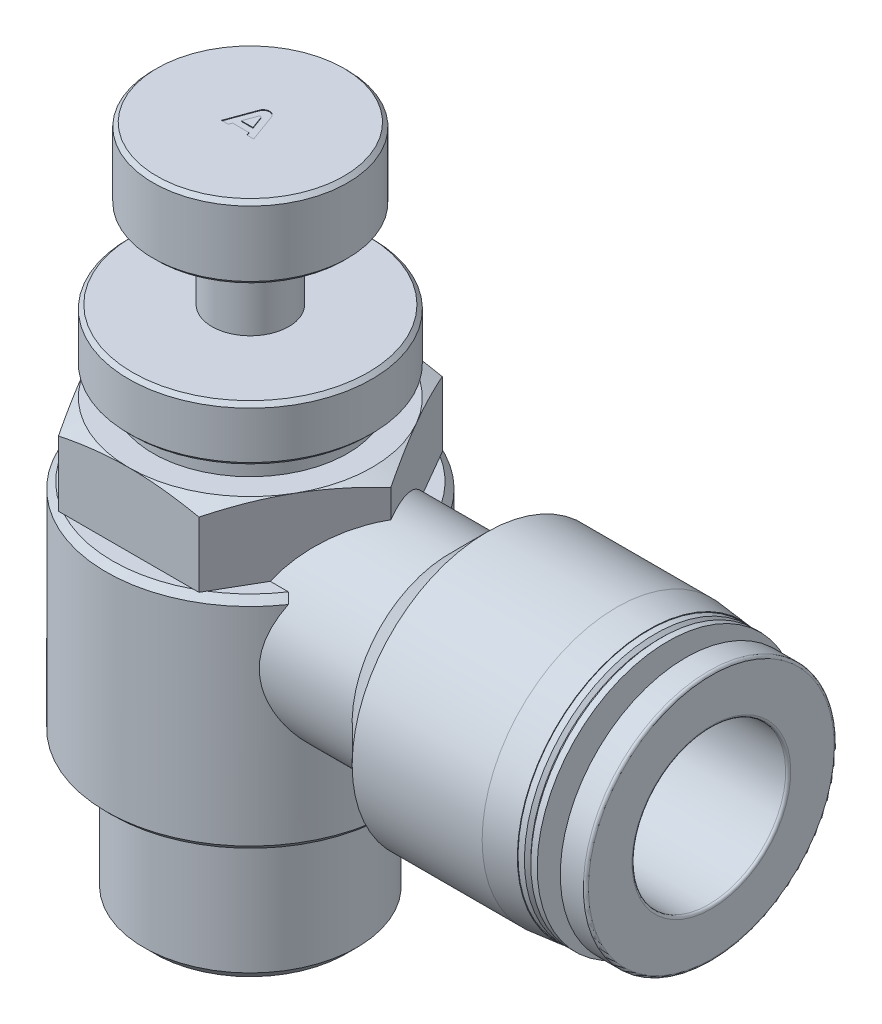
ISO-10303-21;
HEADER;
FILE_DESCRIPTION(('STEP AP214'),'2;1');
FILE_NAME('part.step','',(''),(''),'','','');
FILE_SCHEMA(('AUTOMOTIVE_DESIGN { 1 0 10303 214 1 1 1 1 }'));
ENDSEC;
DATA;
#1=APPLICATION_CONTEXT('core data for automotive mechanical design processes');
#2=APPLICATION_PROTOCOL_DEFINITION('international standard','automotive_design',2000,#1);
#3=PRODUCT_CONTEXT('',#1,'mechanical');
#4=PRODUCT('Part','Part','',(#3));
#5=PRODUCT_RELATED_PRODUCT_CATEGORY('part','',(#4));
#6=PRODUCT_DEFINITION_FORMATION('','',#4);
#7=PRODUCT_DEFINITION_CONTEXT('part definition',#1,'design');
#8=PRODUCT_DEFINITION('design','',#6,#7);
#9=PRODUCT_DEFINITION_SHAPE('','',#8);
#10=(LENGTH_UNIT() NAMED_UNIT(*) SI_UNIT(.MILLI.,.METRE.));
#11=(NAMED_UNIT(*) PLANE_ANGLE_UNIT() SI_UNIT($,.RADIAN.));
#12=(NAMED_UNIT(*) SI_UNIT($,.STERADIAN.) SOLID_ANGLE_UNIT());
#13=UNCERTAINTY_MEASURE_WITH_UNIT(LENGTH_MEASURE(1.E-05),#10,'distance_accuracy_value','');
#14=(GEOMETRIC_REPRESENTATION_CONTEXT(3) GLOBAL_UNCERTAINTY_ASSIGNED_CONTEXT((#13)) GLOBAL_UNIT_ASSIGNED_CONTEXT((#10,
#11,#12)) REPRESENTATION_CONTEXT('',''));
#15=CARTESIAN_POINT('',(0.,0.,0.));
#16=DIRECTION('',(0.,0.,1.));
#17=DIRECTION('',(1.,0.,0.));
#18=AXIS2_PLACEMENT_3D('',#15,#16,#17);
#19=CARTESIAN_POINT('',(0.,2.777,0.));
#20=DIRECTION('',(0.,-1.,0.));
#21=DIRECTION('',(-1.,0.,0.));
#22=AXIS2_PLACEMENT_3D('',#19,#20,#21);
#23=SPHERICAL_SURFACE('',#22,2.777);
#24=CARTESIAN_POINT('',(-0.00019999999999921,2.88080663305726,-2.775059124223));
#25=CARTESIAN_POINT('',(0.0605910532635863,2.88077850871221,-2.77507014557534));
#26=CARTESIAN_POINT('',(0.12137092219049,2.88279334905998,-2.77299633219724));
#27=CARTESIAN_POINT('',(0.242349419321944,2.89072955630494,-2.76473183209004));
#28=CARTESIAN_POINT('',(0.302548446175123,2.89664801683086,-2.7585442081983));
#29=CARTESIAN_POINT('',(0.42145620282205,2.91215488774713,-2.74216564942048));
#30=CARTESIAN_POINT('',(0.480172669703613,2.92171578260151,-2.73200471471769));
#31=CARTESIAN_POINT('',(0.596129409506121,2.94418502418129,-2.70777540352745));
#32=CARTESIAN_POINT('',(0.653369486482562,2.95709381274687,-2.69370651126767));
#33=CARTESIAN_POINT('',(0.821996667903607,3.0001992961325,-2.64587433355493));
#34=CARTESIAN_POINT('',(0.930708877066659,3.03483399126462,-2.60642732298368));
#35=CARTESIAN_POINT('',(1.13878275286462,3.11233880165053,-2.51336433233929));
#36=CARTESIAN_POINT('',(1.23812758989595,3.15522333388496,-2.45972348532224));
#37=CARTESIAN_POINT('',(1.43293455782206,3.2486773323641,-2.33507397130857));
#38=CARTESIAN_POINT('',(1.52762134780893,3.29957614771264,-2.26310320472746));
#39=CARTESIAN_POINT('',(1.70418544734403,3.402312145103,-2.10549992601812));
#40=CARTESIAN_POINT('',(1.78606027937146,3.45414950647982,-2.01986477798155));
#41=CARTESIAN_POINT('',(1.94845252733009,3.56299536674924,-1.82200130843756));
#42=CARTESIAN_POINT('',(2.02677082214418,3.61955115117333,-1.70770844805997));
#43=CARTESIAN_POINT('',(2.16555715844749,3.72431037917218,-1.46525512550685));
#44=CARTESIAN_POINT('',(2.226018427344,3.77251065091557,-1.33708942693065));
#45=CARTESIAN_POINT('',(2.33116675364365,3.85873984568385,-1.06375530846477));
#46=CARTESIAN_POINT('',(2.37499999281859,3.89619871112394,-0.918075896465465));
#47=CARTESIAN_POINT('',(2.44251175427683,3.95475730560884,-0.618963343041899));
#48=CARTESIAN_POINT('',(2.46619241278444,3.97585876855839,-0.465531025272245));
#49=CARTESIAN_POINT('',(2.49291958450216,3.99972563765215,-0.159021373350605));
#50=CARTESIAN_POINT('',(2.49642374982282,4.00289769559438,-0.00601553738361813));
#51=CARTESIAN_POINT('',(2.48399472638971,3.9917519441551,0.298551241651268));
#52=CARTESIAN_POINT('',(2.46806305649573,3.97743550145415,0.450112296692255));
#53=CARTESIAN_POINT('',(2.41723099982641,3.93272814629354,0.745427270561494));
#54=CARTESIAN_POINT('',(2.38258584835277,3.90255366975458,0.889258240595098));
#55=CARTESIAN_POINT('',(2.29472372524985,3.82856127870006,1.16740450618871));
#56=CARTESIAN_POINT('',(2.24150627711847,3.78474301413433,1.30171955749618));
#57=CARTESIAN_POINT('',(2.11549993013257,3.68586388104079,1.56010508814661));
#58=CARTESIAN_POINT('',(2.04233445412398,3.63059218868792,1.68391116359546));
#59=CARTESIAN_POINT('',(1.87720796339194,3.51406146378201,1.91524487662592));
#60=CARTESIAN_POINT('',(1.78523429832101,3.45279841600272,2.02276147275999));
#61=CARTESIAN_POINT('',(1.58133360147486,3.32914040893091,2.22050487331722));
#62=CARTESIAN_POINT('',(1.46910778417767,3.26674317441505,2.31042375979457));
#63=CARTESIAN_POINT('',(1.22680515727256,3.14916844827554,2.4682871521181));
#64=CARTESIAN_POINT('',(1.09675440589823,3.09398064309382,2.53626325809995));
#65=CARTESIAN_POINT('',(0.856722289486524,3.01106533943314,2.63372205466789));
#66=CARTESIAN_POINT('',(0.750094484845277,2.97992427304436,2.66860162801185));
#67=CARTESIAN_POINT('',(0.530624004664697,2.9293518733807,2.72402809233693));
#68=CARTESIAN_POINT('',(0.417796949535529,2.90989246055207,2.74460937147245));
#69=CARTESIAN_POINT('',(0.253261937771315,2.89189679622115,2.76350953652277));
#70=CARTESIAN_POINT('',(0.202759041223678,2.88774671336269,2.76784046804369));
#71=CARTESIAN_POINT('',(0.101446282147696,2.88219755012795,2.77361630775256));
#72=CARTESIAN_POINT('',(0.050636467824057,2.88079804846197,2.77506165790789));
#73=CARTESIAN_POINT('',(-0.000199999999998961,2.88080663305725,2.775059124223));
#74=B_SPLINE_CURVE_WITH_KNOTS('',3,(#24,#25,#26,#27,#28,#29,#30,#31,#32,#33,#34,#35,#36,#37,#38,
#39,#40,#41,#42,#43,#44,#45,#46,#47,#48,#49,#50,#51,#52,#53,#54,#55,#56,#57,#58,#59,#60,#61,#62,
#63,#64,#65,#66,#67,#68,#69,#70,#71,#72,#73),.UNSPECIFIED.,.F.,.F.,(4,2,2,2,2,2,2,2,2,2,2,2,2,2,
2,2,2,2,2,2,2,2,2,2,4),(0.,0.182285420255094,0.364435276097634,0.545235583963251,
0.726059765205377,1.0864465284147,1.44746890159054,1.83410120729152,2.2208081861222,
2.66776750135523,3.11489611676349,3.58259827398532,4.05025084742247,4.50725280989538,
4.96421906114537,5.41510452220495,5.86600155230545,6.32608305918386,6.78647503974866,
7.25431665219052,7.72148148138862,8.06937091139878,8.41642072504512,8.56886133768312,
8.72127860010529),.UNSPECIFIED.);
#75=CARTESIAN_POINT('',(0.,2.88080662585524,-2.77505913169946));
#76=VERTEX_POINT('',#75);
#77=CARTESIAN_POINT('',(0.,2.88080662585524,2.77505913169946));
#78=VERTEX_POINT('',#77);
#79=EDGE_CURVE('E373',#76,#78,#74,.T.);
#80=ORIENTED_EDGE('',*,*,#79,.T.);
#81=CARTESIAN_POINT('',(0.,2.777,0.));
#82=DIRECTION('',(1.,0.,0.));
#83=DIRECTION('',(0.,1.,0.));
#84=AXIS2_PLACEMENT_3D('',#81,#82,#83);
#85=CIRCLE('',#84,2.777);
#86=CARTESIAN_POINT('',(0.,2.777,2.77699999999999));
#87=VERTEX_POINT('',#86);
#88=EDGE_CURVE('E1212',#78,#87,#85,.T.);
#89=ORIENTED_EDGE('',*,*,#88,.T.);
#90=CARTESIAN_POINT('',(0.,2.777,0.));
#91=DIRECTION('',(0.,-1.,0.));
#92=DIRECTION('',(0.,0.,-1.));
#93=AXIS2_PLACEMENT_3D('',#90,#91,#92);
#94=CIRCLE('',#93,2.77699999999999);
#95=CARTESIAN_POINT('',(0.,2.777,-2.77699999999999));
#96=VERTEX_POINT('',#95);
#97=EDGE_CURVE('E429',#87,#96,#94,.T.);
#98=ORIENTED_EDGE('',*,*,#97,.T.);
#99=EDGE_CURVE('E1211',#96,#76,#85,.T.);
#100=ORIENTED_EDGE('',*,*,#99,.T.);
#101=EDGE_LOOP('',(#80,#89,#98,#100));
#102=FACE_BOUND('',#101,.T.);
#103=ADVANCED_FACE('F39',(#102),#23,.F.);
#104=CARTESIAN_POINT('',(0.,5.554,0.));
#105=DIRECTION('',(0.,-1.,0.));
#106=DIRECTION('',(0.,0.,-1.));
#107=AXIS2_PLACEMENT_3D('',#104,#105,#106);
#108=CYLINDRICAL_SURFACE('',#107,2.77699999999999);
#109=ORIENTED_EDGE('',*,*,#97,.F.);
#110=DIRECTION('',(0.,-1.,0.));
#111=VECTOR('',#110,1.);
#112=CARTESIAN_POINT('',(0.,5.554,2.77699999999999));
#113=LINE('',#112,#111);
#114=CARTESIAN_POINT('',(0.,0.,2.77699999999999));
#115=VERTEX_POINT('',#114);
#116=EDGE_CURVE('E381',#87,#115,#113,.T.);
#117=ORIENTED_EDGE('',*,*,#116,.T.);
#118=CARTESIAN_POINT('',(0.,0.,0.));
#119=DIRECTION('',(0.,-1.,0.));
#120=DIRECTION('',(0.,0.,-1.));
#121=AXIS2_PLACEMENT_3D('',#118,#119,#120);
#122=CIRCLE('',#121,2.77699999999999);
#123=CARTESIAN_POINT('',(0.,0.,-2.77699999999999));
#124=VERTEX_POINT('',#123);
#125=EDGE_CURVE('E436',#115,#124,#122,.T.);
#126=ORIENTED_EDGE('',*,*,#125,.T.);
#127=DIRECTION('',(0.,-1.,0.));
#128=VECTOR('',#127,1.);
#129=CARTESIAN_POINT('',(0.,5.554,-2.77699999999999));
#130=LINE('',#129,#128);
#131=EDGE_CURVE('E432',#124,#96,#130,.F.);
#132=ORIENTED_EDGE('',*,*,#131,.T.);
#133=EDGE_LOOP('',(#109,#117,#126,#132));
#134=FACE_BOUND('',#133,.T.);
#135=ADVANCED_FACE('F417',(#134),#108,.F.);
#136=CARTESIAN_POINT('',(-4.16549999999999,0.,0.));
#137=DIRECTION('',(0.,-1.,0.));
#138=DIRECTION('',(0.,0.,-1.));
#139=AXIS2_PLACEMENT_3D('',#136,#137,#138);
#140=PLANE('',#139);
#141=ORIENTED_EDGE('',*,*,#125,.F.);
#142=DIRECTION('',(0.,0.,1.));
#143=VECTOR('',#142,1.);
#144=CARTESIAN_POINT('',(0.,0.,0.));
#145=LINE('',#144,#143);
#146=CARTESIAN_POINT('',(0.,0.,4.00000000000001));
#147=VERTEX_POINT('',#146);
#148=EDGE_CURVE('E11',#115,#147,#145,.T.);
#149=ORIENTED_EDGE('',*,*,#148,.T.);
#150=DIRECTION('',(-1.,0.,0.));
#151=VECTOR('',#150,1.);
#152=CARTESIAN_POINT('',(36.,0.,4.00000000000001));
#153=LINE('',#152,#151);
#154=CARTESIAN_POINT('',(1.16249311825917,0.,4.00000000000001));
#155=VERTEX_POINT('',#154);
#156=EDGE_CURVE('E370',#147,#155,#153,.F.);
#157=ORIENTED_EDGE('',*,*,#156,.T.);
#158=CARTESIAN_POINT('',(0.,0.,0.));
#159=DIRECTION('',(0.,-1.,0.));
#160=DIRECTION('',(0.,0.,-1.));
#161=AXIS2_PLACEMENT_3D('',#158,#159,#160);
#162=CIRCLE('',#161,4.16549999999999);
#163=CARTESIAN_POINT('',(1.16249311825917,0.,-4.));
#164=VERTEX_POINT('',#163);
#165=EDGE_CURVE('E441',#155,#164,#162,.T.);
#166=ORIENTED_EDGE('',*,*,#165,.T.);
#167=DIRECTION('',(-1.,0.,0.));
#168=VECTOR('',#167,1.);
#169=CARTESIAN_POINT('',(36.,0.,-4.00000000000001));
#170=LINE('',#169,#168);
#171=CARTESIAN_POINT('',(0.,0.,-4.00000000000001));
#172=VERTEX_POINT('',#171);
#173=EDGE_CURVE('E367',#164,#172,#170,.T.);
#174=ORIENTED_EDGE('',*,*,#173,.T.);
#175=EDGE_CURVE('E43',#172,#124,#145,.T.);
#176=ORIENTED_EDGE('',*,*,#175,.T.);
#177=EDGE_LOOP('',(#141,#149,#157,#166,#174,#176));
#178=FACE_BOUND('',#177,.T.);
#179=ADVANCED_FACE('F413',(#178),#140,.T.);
#180=CARTESIAN_POINT('',(0.,5.554,0.));
#181=DIRECTION('',(0.,-1.,0.));
#182=DIRECTION('',(0.,0.,-1.));
#183=AXIS2_PLACEMENT_3D('',#180,#181,#182);
#184=CYLINDRICAL_SURFACE('',#183,4.1655);
#185=CARTESIAN_POINT('',(0.,-23.2,0.));
#186=DIRECTION('',(0.,-1.,0.));
#187=DIRECTION('',(0.,0.,-1.));
#188=AXIS2_PLACEMENT_3D('',#185,#186,#187);
#189=CIRCLE('',#188,4.1655);
#190=CARTESIAN_POINT('',(0.,-23.2,-4.1655));
#191=VERTEX_POINT('',#190);
#192=EDGE_CURVE('E1204',#191,#191,#189,.T.);
#193=ORIENTED_EDGE('',*,*,#192,.T.);
#194=EDGE_LOOP('',(#193));
#195=FACE_BOUND('',#194,.T.);
#196=ORIENTED_EDGE('',*,*,#165,.F.);
#197=CARTESIAN_POINT('',(1.16249311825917,0.,4.00000000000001));
#198=CARTESIAN_POINT('',(1.1624580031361,-0.0382223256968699,4.00000514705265));
#199=CARTESIAN_POINT('',(1.16437912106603,-0.0764075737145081,3.99945202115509));
#200=CARTESIAN_POINT('',(1.1718280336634,-0.15229090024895,3.99727837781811));
#201=CARTESIAN_POINT('',(1.17734577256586,-0.189990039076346,3.99566083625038));
#202=CARTESIAN_POINT('',(1.19857170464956,-0.3005854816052,3.98936415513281));
#203=CARTESIAN_POINT('',(1.21897738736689,-0.372509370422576,3.98323662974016));
#204=CARTESIAN_POINT('',(1.26436185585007,-0.500150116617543,3.96903422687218));
#205=CARTESIAN_POINT('',(1.28789068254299,-0.556481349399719,3.96149642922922));
#206=CARTESIAN_POINT('',(1.33928934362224,-0.666839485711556,3.94441819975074));
#207=CARTESIAN_POINT('',(1.36716246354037,-0.720864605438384,3.93487625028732));
#208=CARTESIAN_POINT('',(1.45592731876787,-0.881136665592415,3.90328012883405));
#209=CARTESIAN_POINT('',(1.52141783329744,-0.984245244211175,3.87841457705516));
#210=CARTESIAN_POINT('',(1.67037445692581,-1.20256302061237,3.8169226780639));
#211=CARTESIAN_POINT('',(1.75495327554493,-1.31660512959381,3.77898452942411));
#212=CARTESIAN_POINT('',(1.92734122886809,-1.53886885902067,3.69405155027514));
#213=CARTESIAN_POINT('',(2.01515345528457,-1.64708465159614,3.64704785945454));
#214=CARTESIAN_POINT('',(2.19115279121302,-1.8582614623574,3.54409591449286));
#215=CARTESIAN_POINT('',(2.27933816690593,-1.96123632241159,3.48817302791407));
#216=CARTESIAN_POINT('',(2.45464624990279,-2.16248135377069,3.36711343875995));
#217=CARTESIAN_POINT('',(2.54176942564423,-2.26075365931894,3.30198097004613));
#218=CARTESIAN_POINT('',(2.70790024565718,-2.44599467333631,3.16691274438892));
#219=CARTESIAN_POINT('',(2.78705866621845,-2.53327858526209,3.09759821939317));
#220=CARTESIAN_POINT('',(2.94237054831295,-2.70320860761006,2.95047600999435));
#221=CARTESIAN_POINT('',(3.01852352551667,-2.7858539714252,2.87266696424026));
#222=CARTESIAN_POINT('',(3.24085191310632,-3.02578568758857,2.62623126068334));
#223=CARTESIAN_POINT('',(3.38123811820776,-3.1754437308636,2.4443275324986));
#224=CARTESIAN_POINT('',(3.60271772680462,-3.410165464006,2.09812393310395));
#225=CARTESIAN_POINT('',(3.68965070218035,-3.50182287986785,1.94200782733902));
#226=CARTESIAN_POINT('',(3.8454691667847,-3.66563625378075,1.61151576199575));
#227=CARTESIAN_POINT('',(3.9143781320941,-3.7378175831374,1.43716397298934));
#228=CARTESIAN_POINT('',(4.02088698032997,-3.84920288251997,1.10014195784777));
#229=CARTESIAN_POINT('',(4.06161053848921,-3.89170571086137,0.939559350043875));
#230=CARTESIAN_POINT('',(4.12386905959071,-3.95663903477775,0.610758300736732));
#231=CARTESIAN_POINT('',(4.1454146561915,-3.97908065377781,0.442544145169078));
#232=CARTESIAN_POINT('',(4.16772087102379,-4.00231404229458,0.102743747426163));
#233=CARTESIAN_POINT('',(4.16842235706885,-4.00304421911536,-0.0688507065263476));
#234=CARTESIAN_POINT('',(4.14883254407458,-3.98264097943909,-0.409513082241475));
#235=CARTESIAN_POINT('',(4.12853808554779,-3.96150427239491,-0.578580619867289));
#236=CARTESIAN_POINT('',(4.06979871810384,-3.90024906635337,-0.902257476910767));
#237=CARTESIAN_POINT('',(4.03215428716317,-3.86096755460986,-1.05717583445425));
#238=CARTESIAN_POINT('',(3.94136779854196,-3.76605633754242,-1.35705418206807));
#239=CARTESIAN_POINT('',(3.88822111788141,-3.71042175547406,-1.50201118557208));
#240=CARTESIAN_POINT('',(3.74541758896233,-3.56054371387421,-1.83515669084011));
#241=CARTESIAN_POINT('',(3.6496345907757,-3.45973321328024,-2.01776381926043));
#242=CARTESIAN_POINT('',(3.43952018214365,-3.23732244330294,-2.3582442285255));
#243=CARTESIAN_POINT('',(3.32514074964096,-3.11566830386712,-2.51605133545));
#244=CARTESIAN_POINT('',(3.12217747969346,-2.89786490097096,-2.7604309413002));
#245=CARTESIAN_POINT('',(3.03696399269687,-2.80591480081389,-2.85369371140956));
#246=CARTESIAN_POINT('',(2.86214558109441,-2.61570237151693,-3.02899846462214));
#247=CARTESIAN_POINT('',(2.77254046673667,-2.51743976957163,-3.11103996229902));
#248=CARTESIAN_POINT('',(2.59052498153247,-2.31545894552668,-3.2641533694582));
#249=CARTESIAN_POINT('',(2.49811799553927,-2.21174720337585,-3.33523792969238));
#250=CARTESIAN_POINT('',(2.31195146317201,-1.99909679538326,-3.46687885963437));
#251=CARTESIAN_POINT('',(2.2181925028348,-1.8901603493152,-3.52743965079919));
#252=CARTESIAN_POINT('',(2.03063324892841,-1.66609605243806,-3.63866397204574));
#253=CARTESIAN_POINT('',(1.93683618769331,-1.55093450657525,-3.68926491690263));
#254=CARTESIAN_POINT('',(1.7524207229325,-1.31351243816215,-3.78033641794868));
#255=CARTESIAN_POINT('',(1.66181236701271,-1.19123222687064,-3.82077705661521));
#256=CARTESIAN_POINT('',(1.51027209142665,-0.966787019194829,-3.88272211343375));
#257=CARTESIAN_POINT('',(1.44735182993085,-0.866594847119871,-3.90644322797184));
#258=CARTESIAN_POINT('',(1.33353936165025,-0.65911631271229,-3.94672216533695));
#259=CARTESIAN_POINT('',(1.28252888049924,-0.55191455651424,-3.96335191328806));
#260=CARTESIAN_POINT('',(1.21831543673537,-0.370221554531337,-3.98344178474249));
#261=CARTESIAN_POINT('',(1.19810918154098,-0.298640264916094,-3.989503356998));
#262=CARTESIAN_POINT('',(1.17713585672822,-0.188651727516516,-3.99572205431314));
#263=CARTESIAN_POINT('',(1.17169548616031,-0.151212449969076,-3.99731693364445));
#264=CARTESIAN_POINT('',(1.1643530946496,-0.075860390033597,-3.99945979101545));
#265=CARTESIAN_POINT('',(1.16246070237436,-0.0379465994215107,-4.00000492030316));
#266=CARTESIAN_POINT('',(1.16249311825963,1.63364834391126E-13,-4.00000000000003));
#267=B_SPLINE_CURVE_WITH_KNOTS('',3,(#197,#198,#199,#200,#201,#202,#203,#204,#205,#206,#207,
#208,#209,#210,#211,#212,#213,#214,#215,#216,#217,#218,#219,#220,#221,#222,#223,#224,#225,#226,
#227,#228,#229,#230,#231,#232,#233,#234,#235,#236,#237,#238,#239,#240,#241,#242,#243,#244,#245,
#246,#247,#248,#249,#250,#251,#252,#253,#254,#255,#256,#257,#258,#259,#260,#261,#262,#263,#264,
#265,#266),.UNSPECIFIED.,.F.,.F.,(4,2,2,2,2,2,2,2,2,2,2,2,2,2,2,2,2,2,2,2,2,2,2,2,2,2,2,2,2,2,2,
2,2,2,4),(0.,0.11455155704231,0.228784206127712,0.452735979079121,0.637024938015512,
0.821453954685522,1.19462476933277,1.63503313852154,2.07587414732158,2.51548299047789,
2.95489038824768,3.3646297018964,3.77443477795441,4.59233834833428,5.19272491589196,
5.79232554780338,6.30322301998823,6.8138370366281,7.32589946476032,7.83803895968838,
8.32860773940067,8.81932296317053,9.50415191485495,10.1907782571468,10.6589573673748,
11.1271567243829,11.5948113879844,12.0622690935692,12.5325764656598,13.0042528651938,
13.3657579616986,13.7235038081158,13.9463397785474,14.0597660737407,14.1734997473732),.UNSPECIFIED.);
#268=EDGE_CURVE('E394',#155,#164,#267,.T.);
#269=ORIENTED_EDGE('',*,*,#268,.T.);
#270=EDGE_LOOP('',(#196,#269));
#271=FACE_BOUND('',#270,.T.);
#272=ADVANCED_FACE('F408',(#195,#271),#184,.F.);
#273=CARTESIAN_POINT('',(0.,4.7,0.));
#274=DIRECTION('',(0.,1.,0.));
#275=DIRECTION('',(0.,0.,1.));
#276=AXIS2_PLACEMENT_3D('',#273,#274,#275);
#277=PLANE('',#276);
#278=CARTESIAN_POINT('',(0.,4.7,0.));
#279=DIRECTION('',(0.,1.,0.));
#280=DIRECTION('',(0.,0.,1.));
#281=AXIS2_PLACEMENT_3D('',#278,#279,#280);
#282=CIRCLE('',#281,10.75);
#283=CARTESIAN_POINT('',(5.7116648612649,4.7,9.10710626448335));
#284=VERTEX_POINT('',#283);
#285=CARTESIAN_POINT('',(8.93826045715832,4.7,5.97243668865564));
#286=VERTEX_POINT('',#285);
#287=EDGE_CURVE('E858',#284,#286,#282,.T.);
#288=ORIENTED_EDGE('',*,*,#287,.T.);
#289=DIRECTION('',(-1.,0.,0.));
#290=VECTOR('',#289,1.);
#291=CARTESIAN_POINT('',(36.,4.7,5.97243668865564));
#292=LINE('',#291,#290);
#293=CARTESIAN_POINT('',(7.52146718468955,4.7,5.97243668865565));
#294=VERTEX_POINT('',#293);
#295=EDGE_CURVE('E757',#286,#294,#292,.T.);
#296=ORIENTED_EDGE('',*,*,#295,.T.);
#297=DIRECTION('',(0.5,0.,-0.866025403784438));
#298=VECTOR('',#297,1.);
#299=CARTESIAN_POINT('',(5.48482755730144,4.7,9.5));
#300=LINE('',#299,#298);
#301=EDGE_CURVE('E779',#284,#294,#300,.T.);
#302=ORIENTED_EDGE('',*,*,#301,.F.);
#303=EDGE_LOOP('',(#288,#296,#302));
#304=FACE_BOUND('',#303,.T.);
#305=ADVANCED_FACE('F412',(#304),#277,.T.);
#306=DIRECTION('',(-0.5,0.,-0.866025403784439));
#307=VECTOR('',#306,1.);
#308=CARTESIAN_POINT('',(10.9696551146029,4.7,0.));
#309=LINE('',#308,#307);
#310=CARTESIAN_POINT('',(7.52146718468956,4.7,-5.97243668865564));
#311=VERTEX_POINT('',#310);
#312=CARTESIAN_POINT('',(5.7116648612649,4.7,-9.10710626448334));
#313=VERTEX_POINT('',#312);
#314=EDGE_CURVE('E785',#311,#313,#309,.T.);
#315=ORIENTED_EDGE('',*,*,#314,.F.);
#316=DIRECTION('',(-1.,0.,0.));
#317=VECTOR('',#316,1.);
#318=CARTESIAN_POINT('',(36.,4.7,-5.97243668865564));
#319=LINE('',#318,#317);
#320=CARTESIAN_POINT('',(8.93826045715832,4.7,-5.97243668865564));
#321=VERTEX_POINT('',#320);
#322=EDGE_CURVE('E502',#311,#321,#319,.F.);
#323=ORIENTED_EDGE('',*,*,#322,.T.);
#324=EDGE_CURVE('E851',#321,#313,#282,.T.);
#325=ORIENTED_EDGE('',*,*,#324,.T.);
#326=EDGE_LOOP('',(#315,#323,#325));
#327=FACE_BOUND('',#326,.T.);
#328=ADVANCED_FACE('F609',(#327),#277,.T.);
#329=CARTESIAN_POINT('',(0.,29.,0.));
#330=DIRECTION('',(0.,-1.,0.));
#331=DIRECTION('',(0.,0.,-1.));
#332=AXIS2_PLACEMENT_3D('',#329,#330,#331);
#333=CYLINDRICAL_SURFACE('',#332,11.25);
#334=CARTESIAN_POINT('',(0.,-12.,0.));
#335=DIRECTION('',(0.,-1.,0.));
#336=DIRECTION('',(0.,0.,-1.));
#337=AXIS2_PLACEMENT_3D('',#334,#335,#336);
#338=CIRCLE('',#337,11.25);
#339=CARTESIAN_POINT('',(0.,-12.,-11.25));
#340=VERTEX_POINT('',#339);
#341=EDGE_CURVE('E707',#340,#340,#338,.T.);
#342=ORIENTED_EDGE('',*,*,#341,.F.);
#343=EDGE_LOOP('',(#342));
#344=FACE_BOUND('',#343,.T.);
#345=CARTESIAN_POINT('',(9.29744588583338,4.2,6.33403504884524));
#346=CARTESIAN_POINT('',(9.22868961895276,4.04774769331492,6.43497765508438));
#347=CARTESIAN_POINT('',(9.16104897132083,3.8914707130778,6.53071220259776));
#348=CARTESIAN_POINT('',(9.02955313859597,3.57096892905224,6.71134182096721));
#349=CARTESIAN_POINT('',(8.96570276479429,3.40673448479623,6.79622326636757));
#350=CARTESIAN_POINT('',(8.8430122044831,3.06940093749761,6.95512837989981));
#351=CARTESIAN_POINT('',(8.7842181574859,2.89623941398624,7.02905576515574));
#352=CARTESIAN_POINT('',(8.67411940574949,2.54283683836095,7.16447971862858));
#353=CARTESIAN_POINT('',(8.62281255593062,2.36259783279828,7.2259798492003));
#354=CARTESIAN_POINT('',(8.53658836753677,2.02325989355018,7.32754464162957));
#355=CARTESIAN_POINT('',(8.50036715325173,1.86504051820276,7.36944043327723));
#356=CARTESIAN_POINT('',(8.43588626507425,1.54475124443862,7.44316636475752));
#357=CARTESIAN_POINT('',(8.40762219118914,1.38268352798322,7.47500206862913));
#358=CARTESIAN_POINT('',(8.36014033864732,1.05614010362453,7.52806894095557));
#359=CARTESIAN_POINT('',(8.34088874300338,0.891675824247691,7.54933976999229));
#360=CARTESIAN_POINT('',(8.31203478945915,0.560860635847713,7.58109769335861));
#361=CARTESIAN_POINT('',(8.3024322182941,0.394509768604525,7.59158502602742));
#362=CARTESIAN_POINT('',(8.29326211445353,0.0605405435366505,7.601601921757));
#363=CARTESIAN_POINT('',(8.29373429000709,-0.107080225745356,7.60108812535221));
#364=CARTESIAN_POINT('',(8.30479063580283,-0.441581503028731,7.58900635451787));
#365=CARTESIAN_POINT('',(8.31537476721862,-0.608462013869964,7.57743842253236));
#366=CARTESIAN_POINT('',(8.34623367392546,-0.940471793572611,7.54343470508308));
#367=CARTESIAN_POINT('',(8.36652416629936,-1.10559777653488,7.52098129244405));
#368=CARTESIAN_POINT('',(8.41600981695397,-1.43279677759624,7.46556444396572));
#369=CARTESIAN_POINT('',(8.44521018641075,-1.59486794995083,7.43259485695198));
#370=CARTESIAN_POINT('',(8.51791908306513,-1.94613193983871,7.34922983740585));
#371=CARTESIAN_POINT('',(8.56310579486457,-2.13446987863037,7.29669247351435));
#372=CARTESIAN_POINT('',(8.66271017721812,-2.50435927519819,7.17815689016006));
#373=CARTESIAN_POINT('',(8.71713096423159,-2.68590841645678,7.11215412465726));
#374=CARTESIAN_POINT('',(8.83321590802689,-3.0416281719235,6.96745256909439));
#375=CARTESIAN_POINT('',(8.89488558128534,-3.21579302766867,6.88874409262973));
#376=CARTESIAN_POINT('',(9.023504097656,-3.55611133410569,6.71938992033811));
#377=CARTESIAN_POINT('',(9.09045276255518,-3.72226505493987,6.62874462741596));
#378=CARTESIAN_POINT('',(9.299073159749,-4.21423347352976,6.33621588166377));
#379=CARTESIAN_POINT('',(9.44632637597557,-4.52719440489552,6.11635006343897));
#380=CARTESIAN_POINT('',(9.74245796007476,-5.11642754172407,5.63271610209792));
#381=CARTESIAN_POINT('',(9.89133708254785,-5.39268185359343,5.36892668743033));
#382=CARTESIAN_POINT('',(10.121557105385,-5.80166241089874,4.91457197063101));
#383=CARTESIAN_POINT('',(10.2059950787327,-5.94745243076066,4.73718357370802));
#384=CARTESIAN_POINT('',(10.3692907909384,-6.22351255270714,4.36817810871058));
#385=CARTESIAN_POINT('',(10.4481475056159,-6.35377980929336,4.17655844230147));
#386=CARTESIAN_POINT('',(10.5979959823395,-6.59728793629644,3.78018990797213));
#387=CARTESIAN_POINT('',(10.6689962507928,-6.71054727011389,3.57545562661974));
#388=CARTESIAN_POINT('',(10.8011327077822,-6.91870206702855,3.15385061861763));
#389=CARTESIAN_POINT('',(10.8622725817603,-7.01360439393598,2.93698446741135));
#390=CARTESIAN_POINT('',(10.959261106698,-7.16276990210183,2.54697102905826));
#391=CARTESIAN_POINT('',(10.997640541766,-7.22129861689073,2.37607110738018));
#392=CARTESIAN_POINT('',(11.0669018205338,-7.32634826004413,2.02914969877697));
#393=CARTESIAN_POINT('',(11.0977851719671,-7.37287160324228,1.85312924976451));
#394=CARTESIAN_POINT('',(11.1513891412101,-7.45331326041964,1.49713080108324));
#395=CARTESIAN_POINT('',(11.1741152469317,-7.48724004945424,1.31715554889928));
#396=CARTESIAN_POINT('',(11.2109306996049,-7.54207404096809,0.954345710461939));
#397=CARTESIAN_POINT('',(11.2250198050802,-7.5629808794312,0.771511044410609));
#398=CARTESIAN_POINT('',(11.2442589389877,-7.59150648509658,0.403866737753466));
#399=CARTESIAN_POINT('',(11.249386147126,-7.59909132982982,0.219053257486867));
#400=CARTESIAN_POINT('',(11.2505099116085,-7.60075480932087,-0.150662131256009));
#401=CARTESIAN_POINT('',(11.2465064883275,-7.59483347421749,-0.335564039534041));
#402=CARTESIAN_POINT('',(11.2294625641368,-7.56957171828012,-0.704058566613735));
#403=CARTESIAN_POINT('',(11.2164204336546,-7.55022887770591,-0.887650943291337));
#404=CARTESIAN_POINT('',(11.1816009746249,-7.4984043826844,-1.25212404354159));
#405=CARTESIAN_POINT('',(11.1598237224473,-7.46592284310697,-1.43300479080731));
#406=CARTESIAN_POINT('',(11.1089354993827,-7.38963633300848,-1.78451018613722));
#407=CARTESIAN_POINT('',(11.0801093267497,-7.34626968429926,-1.95527182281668));
#408=CARTESIAN_POINT('',(11.01534478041,-7.24821873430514,-2.29218715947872));
#409=CARTESIAN_POINT('',(10.9794039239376,-7.19353048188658,-2.45833922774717));
#410=CARTESIAN_POINT('',(10.9010963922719,-7.07343465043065,-2.7851048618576));
#411=CARTESIAN_POINT('',(10.8587314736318,-7.00803000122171,-2.94571992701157));
#412=CARTESIAN_POINT('',(10.7683112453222,-6.86709078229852,-3.26081076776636));
#413=CARTESIAN_POINT('',(10.7202538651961,-6.79155252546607,-3.41528428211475));
#414=CARTESIAN_POINT('',(10.5588885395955,-6.53502211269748,-3.89799266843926));
#415=CARTESIAN_POINT('',(10.4361520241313,-6.33576004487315,-4.21360064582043));
#416=CARTESIAN_POINT('',(10.1757140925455,-5.89694304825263,-4.80864827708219));
#417=CARTESIAN_POINT('',(10.037998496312,-5.65734981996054,-5.08805310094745));
#418=CARTESIAN_POINT('',(9.81546389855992,-5.24944280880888,-5.49991296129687));
#419=CARTESIAN_POINT('',(9.73244153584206,-5.09287568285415,-5.64518922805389));
#420=CARTESIAN_POINT('',(9.56644671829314,-4.76801108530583,-5.92213164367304));
#421=CARTESIAN_POINT('',(9.48347427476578,-4.59971156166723,-6.0537954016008));
#422=CARTESIAN_POINT('',(9.31973503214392,-4.2518803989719,-6.30295658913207));
#423=CARTESIAN_POINT('',(9.23896833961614,-4.07234821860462,-6.42045333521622));
#424=CARTESIAN_POINT('',(9.08205232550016,-3.70259861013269,-6.64056507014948));
#425=CARTESIAN_POINT('',(9.00590194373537,-3.51238365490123,-6.74318348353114));
#426=CARTESIAN_POINT('',(8.81630328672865,-3.00169396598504,-6.99087283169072));
#427=CARTESIAN_POINT('',(8.70854532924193,-2.67273487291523,-7.12349709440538));
#428=CARTESIAN_POINT('',(8.57038472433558,-2.16236713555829,-7.28808354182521));
#429=CARTESIAN_POINT('',(8.52825072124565,-1.98946365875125,-7.33721353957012));
#430=CARTESIAN_POINT('',(8.45332141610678,-1.63873042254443,-7.42341679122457));
#431=CARTESIAN_POINT('',(8.42052093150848,-1.4609034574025,-7.46049673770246));
#432=CARTESIAN_POINT('',(8.36536312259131,-1.09954702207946,-7.522296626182));
#433=CARTESIAN_POINT('',(8.34311830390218,-0.915977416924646,-7.54688360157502));
#434=CARTESIAN_POINT('',(8.31067190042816,-0.546461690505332,-7.58259992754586));
#435=CARTESIAN_POINT('',(8.30046997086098,-0.360515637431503,-7.59372966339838));
#436=CARTESIAN_POINT('',(8.29264823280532,0.0118442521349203,-7.60227074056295));
#437=CARTESIAN_POINT('',(8.29502072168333,0.198257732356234,-7.59969048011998));
#438=CARTESIAN_POINT('',(8.31220405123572,0.569801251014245,-7.58089203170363));
#439=CARTESIAN_POINT('',(8.32701402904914,0.754931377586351,-7.5646747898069));
#440=CARTESIAN_POINT('',(8.36538009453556,1.09619768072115,-7.52220702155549));
#441=CARTESIAN_POINT('',(8.38740211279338,1.25272984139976,-7.49770087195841));
#442=CARTESIAN_POINT('',(8.43926771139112,1.56273057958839,-7.43927280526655));
#443=CARTESIAN_POINT('',(8.46911389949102,1.71619811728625,-7.40534774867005));
#444=CARTESIAN_POINT('',(8.56910738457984,2.17132108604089,-7.28994594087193));
#445=CARTESIAN_POINT('',(8.6496688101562,2.4673633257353,-7.19488526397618));
#446=CARTESIAN_POINT('',(8.8211752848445,3.01178482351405,-6.98326095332));
#447=CARTESIAN_POINT('',(8.91029256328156,3.26197692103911,-6.86977343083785));
#448=CARTESIAN_POINT('',(9.05117905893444,3.62402817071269,-6.68167400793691));
#449=CARTESIAN_POINT('',(9.09920151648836,3.74219966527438,-6.6161999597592));
#450=CARTESIAN_POINT('',(9.1970898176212,3.97429413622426,-6.47943761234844));
#451=CARTESIAN_POINT('',(9.24695516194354,4.08821824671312,-6.40815088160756));
#452=CARTESIAN_POINT('',(9.29744588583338,4.2,-6.33403504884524));
#453=B_SPLINE_CURVE_WITH_KNOTS('',3,(#345,#346,#347,#348,#349,#350,#351,#352,#353,#354,#355,
#356,#357,#358,#359,#360,#361,#362,#363,#364,#365,#366,#367,#368,#369,#370,#371,#372,#373,#374,
#375,#376,#377,#378,#379,#380,#381,#382,#383,#384,#385,#386,#387,#388,#389,#390,#391,#392,#393,
#394,#395,#396,#397,#398,#399,#400,#401,#402,#403,#404,#405,#406,#407,#408,#409,#410,#411,#412,
#413,#414,#415,#416,#417,#418,#419,#420,#421,#422,#423,#424,#425,#426,#427,#428,#429,#430,#431,
#432,#433,#434,#435,#436,#437,#438,#439,#440,#441,#442,#443,#444,#445,#446,#447,#448,#449,#450,
#451,#452),.UNSPECIFIED.,.F.,.F.,(4,2,2,2,2,2,2,2,2,2,2,2,2,2,2,2,2,2,2,2,2,2,2,2,2,2,2,2,2,2,2,
2,2,2,2,2,2,2,2,2,2,2,2,2,2,2,2,2,2,2,2,2,2,4),(0.,0.585525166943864,1.17177835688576,
1.76291254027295,2.3538770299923,2.85628320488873,3.35841102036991,3.85863932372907,
4.35885657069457,4.86104571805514,5.3632329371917,5.86623609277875,6.36953400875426,
6.97070719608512,7.57208368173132,8.17392082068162,8.7757376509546,10.0008097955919,
11.2264769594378,11.9595709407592,12.6927991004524,13.4252254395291,14.1573773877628,
14.7108438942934,15.2641989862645,15.8171810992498,16.370178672,16.9245823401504,
17.4789847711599,18.0334871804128,18.5879847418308,19.1229847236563,19.6581717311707,
20.1932126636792,20.7284488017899,21.9024136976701,23.0774997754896,23.7643391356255,
24.4512989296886,25.1382918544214,25.825126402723,26.9322417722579,27.4855516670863,
28.0385537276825,28.5973243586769,29.156078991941,29.7144913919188,30.2728650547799,
30.7522303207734,31.2317555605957,32.1918115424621,33.0564502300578,33.4864177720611,
33.9162696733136),.UNSPECIFIED.);
#454=CARTESIAN_POINT('',(9.29744588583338,4.2,6.33403504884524));
#455=VERTEX_POINT('',#454);
#456=CARTESIAN_POINT('',(9.29744588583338,4.2,-6.33403504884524));
#457=VERTEX_POINT('',#456);
#458=EDGE_CURVE('E495',#455,#457,#453,.T.);
#459=ORIENTED_EDGE('',*,*,#458,.F.);
#460=CARTESIAN_POINT('',(0.,4.2,0.));
#461=DIRECTION('',(0.,-1.,0.));
#462=DIRECTION('',(0.,0.,-1.));
#463=AXIS2_PLACEMENT_3D('',#460,#461,#462);
#464=CIRCLE('',#463,11.25);
#465=EDGE_CURVE('E703',#455,#457,#464,.T.);
#466=ORIENTED_EDGE('',*,*,#465,.T.);
#467=EDGE_LOOP('',(#459,#466));
#468=FACE_BOUND('',#467,.T.);
#469=ADVANCED_FACE('F504',(#344,#468),#333,.T.);
#470=CARTESIAN_POINT('',(0.,4.7,0.));
#471=DIRECTION('',(0.,-1.,0.));
#472=DIRECTION('',(0.,0.,-1.));
#473=AXIS2_PLACEMENT_3D('',#470,#471,#472);
#474=CONICAL_SURFACE('',#473,10.75,0.78539816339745);
#475=CARTESIAN_POINT('',(8.90449999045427,4.7502,5.93258796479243));
#476=CARTESIAN_POINT('',(8.93757872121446,4.70069048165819,5.97223018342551));
#477=CARTESIAN_POINT('',(8.97142354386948,4.65099859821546,6.01100106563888));
#478=CARTESIAN_POINT('',(9.04054135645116,4.55136666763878,6.08678689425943));
#479=CARTESIAN_POINT('',(9.07581296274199,4.50142690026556,6.12380346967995));
#480=CARTESIAN_POINT('',(9.14774273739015,4.40132244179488,6.19614190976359));
#481=CARTESIAN_POINT('',(9.18440088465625,4.351157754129,6.2314638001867));
#482=CARTESIAN_POINT('',(9.25906601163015,4.25061360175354,6.30047657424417));
#483=CARTESIAN_POINT('',(9.29707423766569,4.20023397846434,6.33416587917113));
#484=CARTESIAN_POINT('',(9.33570351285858,4.1498,6.36703698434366));
#485=B_SPLINE_CURVE_WITH_KNOTS('',3,(#475,#476,#477,#478,#479,#480,#481,#482,#483,#484),
.UNSPECIFIED.,.F.,.F.,(4,2,2,2,4),(0.,0.214584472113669,0.428965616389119,0.643343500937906,
0.857924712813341),.UNSPECIFIED.);
#486=EDGE_CURVE('E401',#286,#455,#485,.T.);
#487=ORIENTED_EDGE('',*,*,#486,.F.);
#488=ORIENTED_EDGE('',*,*,#287,.F.);
#489=CARTESIAN_POINT('',(0.,4.7,0.));
#490=DIRECTION('',(0.,-1.,0.));
#491=DIRECTION('',(0.,0.,-1.));
#492=AXIS2_PLACEMENT_3D('',#489,#490,#491);
#493=CIRCLE('',#492,10.75);
#494=CARTESIAN_POINT('',(5.03115294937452,4.7,9.5));
#495=VERTEX_POINT('',#494);
#496=EDGE_CURVE('E704',#284,#495,#493,.T.);
#497=ORIENTED_EDGE('',*,*,#496,.T.);
#498=CARTESIAN_POINT('',(-5.03115294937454,4.7,9.5));
#499=VERTEX_POINT('',#498);
#500=EDGE_CURVE('E848',#499,#495,#282,.T.);
#501=ORIENTED_EDGE('',*,*,#500,.F.);
#502=CARTESIAN_POINT('',(-5.7116648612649,4.7,9.10710626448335));
#503=VERTEX_POINT('',#502);
#504=EDGE_CURVE('E882',#499,#503,#493,.T.);
#505=ORIENTED_EDGE('',*,*,#504,.T.);
#506=CARTESIAN_POINT('',(-10.7428178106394,4.7,0.39289373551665));
#507=VERTEX_POINT('',#506);
#508=EDGE_CURVE('E850',#507,#503,#282,.T.);
#509=ORIENTED_EDGE('',*,*,#508,.F.);
#510=CARTESIAN_POINT('',(-10.7428178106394,4.7,-0.392893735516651));
#511=VERTEX_POINT('',#510);
#512=EDGE_CURVE('E879',#507,#511,#493,.T.);
#513=ORIENTED_EDGE('',*,*,#512,.T.);
#514=CARTESIAN_POINT('',(-5.7116648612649,4.7,-9.10710626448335));
#515=VERTEX_POINT('',#514);
#516=EDGE_CURVE('E855',#515,#511,#282,.T.);
#517=ORIENTED_EDGE('',*,*,#516,.F.);
#518=CARTESIAN_POINT('',(-5.03115294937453,4.7,-9.5));
#519=VERTEX_POINT('',#518);
#520=EDGE_CURVE('E698',#515,#519,#493,.T.);
#521=ORIENTED_EDGE('',*,*,#520,.T.);
#522=CARTESIAN_POINT('',(5.03115294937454,4.7,-9.5));
#523=VERTEX_POINT('',#522);
#524=EDGE_CURVE('E859',#523,#519,#282,.T.);
#525=ORIENTED_EDGE('',*,*,#524,.F.);
#526=EDGE_CURVE('E700',#523,#313,#493,.T.);
#527=ORIENTED_EDGE('',*,*,#526,.T.);
#528=ORIENTED_EDGE('',*,*,#324,.F.);
#529=CARTESIAN_POINT('',(9.33570351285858,4.1498,-6.36703698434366));
#530=CARTESIAN_POINT('',(9.29707423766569,4.20023397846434,-6.33416587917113));
#531=CARTESIAN_POINT('',(9.25906601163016,4.25061360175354,-6.30047657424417));
#532=CARTESIAN_POINT('',(9.18440088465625,4.351157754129,-6.23146380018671));
#533=CARTESIAN_POINT('',(9.14774273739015,4.40132244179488,-6.19614190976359));
#534=CARTESIAN_POINT('',(9.07581296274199,4.50142690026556,-6.12380346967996));
#535=CARTESIAN_POINT('',(9.04054135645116,4.55136666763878,-6.08678689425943));
#536=CARTESIAN_POINT('',(8.97142354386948,4.65099859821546,-6.01100106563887));
#537=CARTESIAN_POINT('',(8.93757872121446,4.70069048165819,-5.97223018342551));
#538=CARTESIAN_POINT('',(8.90449999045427,4.7502,-5.93258796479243));
#539=B_SPLINE_CURVE_WITH_KNOTS('',3,(#529,#530,#531,#532,#533,#534,#535,#536,#537,#538),
.UNSPECIFIED.,.F.,.F.,(4,2,2,2,4),(0.,0.214581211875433,0.428959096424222,0.643340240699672,
0.85792471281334),.UNSPECIFIED.);
#540=EDGE_CURVE('E521',#457,#321,#539,.T.);
#541=ORIENTED_EDGE('',*,*,#540,.F.);
#542=ORIENTED_EDGE('',*,*,#465,.F.);
#543=EDGE_LOOP('',(#487,#488,#497,#501,#505,#509,#513,#517,#521,#525,#527,#528,#541,#542));
#544=FACE_BOUND('',#543,.T.);
#545=ADVANCED_FACE('F529',(#544),#474,.T.);
#546=CARTESIAN_POINT('',(0.,10.4,0.));
#547=DIRECTION('',(0.,-1.,0.));
#548=DIRECTION('',(0.,0.,-1.));
#549=AXIS2_PLACEMENT_3D('',#546,#547,#548);
#550=CONICAL_SURFACE('',#549,9.5,1.17809724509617);
#551=CARTESIAN_POINT('',(-14.5315894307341,7.14371484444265,-9.5));
#552=CARTESIAN_POINT('',(-14.1030393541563,7.29225069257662,-9.5));
#553=CARTESIAN_POINT('',(-13.6738958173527,7.43910580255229,-9.5));
#554=CARTESIAN_POINT('',(-12.8141134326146,7.72851328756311,-9.5));
#555=CARTESIAN_POINT('',(-12.383474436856,7.87106522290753,-9.5));
#556=CARTESIAN_POINT('',(-11.5193824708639,8.15125030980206,-9.5));
#557=CARTESIAN_POINT('',(-11.0859251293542,8.28887002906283,-9.5));
#558=CARTESIAN_POINT('',(-10.2169681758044,8.55748881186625,-9.5));
#559=CARTESIAN_POINT('',(-9.78146861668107,8.68848804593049,-9.5));
#560=CARTESIAN_POINT('',(-8.91367943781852,8.94055546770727,-9.5));
#561=CARTESIAN_POINT('',(-8.48142084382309,9.06172993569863,-9.5));
#562=CARTESIAN_POINT('',(-7.61415224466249,9.29393202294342,-9.5));
#563=CARTESIAN_POINT('',(-7.17914215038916,9.40495931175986,-9.5));
#564=CARTESIAN_POINT('',(-6.30631063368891,9.61421181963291,-9.5));
#565=CARTESIAN_POINT('',(-5.86849110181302,9.7124448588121,-9.5));
#566=CARTESIAN_POINT('',(-4.9895842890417,9.89307352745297,-9.5));
#567=CARTESIAN_POINT('',(-4.54849727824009,9.97547045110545,-9.5));
#568=CARTESIAN_POINT('',(-3.76277424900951,10.1045845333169,-9.5));
#569=CARTESIAN_POINT('',(-3.41877461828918,10.1551581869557,-9.5));
#570=CARTESIAN_POINT('',(-2.72907921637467,10.2431043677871,-9.5));
#571=CARTESIAN_POINT('',(-2.38338348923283,10.2804772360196,-9.5));
#572=CARTESIAN_POINT('',(-1.69092822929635,10.3406103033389,-9.5));
#573=CARTESIAN_POINT('',(-1.34416950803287,10.3633797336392,-9.5));
#574=CARTESIAN_POINT('',(-0.649974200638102,10.3933925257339,-9.5));
#575=CARTESIAN_POINT('',(-0.302537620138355,10.40063601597,-9.5));
#576=CARTESIAN_POINT('',(0.393951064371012,10.3992729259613,-9.5));
#577=CARTESIAN_POINT('',(0.743003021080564,10.390591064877,-9.5));
#578=CARTESIAN_POINT('',(1.44036344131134,10.3576163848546,-9.5));
#579=CARTESIAN_POINT('',(1.78867189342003,10.3333233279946,-9.5));
#580=CARTESIAN_POINT('',(2.48414493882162,10.2701236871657,-9.5));
#581=CARTESIAN_POINT('',(2.83130876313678,10.2312087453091,-9.5));
#582=CARTESIAN_POINT('',(3.52388269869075,10.140212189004,-9.5));
#583=CARTESIAN_POINT('',(3.86929282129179,10.0881306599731,-9.5));
#584=CARTESIAN_POINT('',(4.62670526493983,9.9609293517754,-9.5));
#585=CARTESIAN_POINT('',(5.03828156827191,9.88328746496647,-9.5));
#586=CARTESIAN_POINT('',(5.85862140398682,9.7142403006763,-9.5));
#587=CARTESIAN_POINT('',(6.26738453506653,9.62283310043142,-9.5));
#588=CARTESIAN_POINT('',(7.08244817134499,9.4287429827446,-9.5));
#589=CARTESIAN_POINT('',(7.48874715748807,9.32605373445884,-9.5));
#590=CARTESIAN_POINT('',(8.29890590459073,9.11158755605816,-9.5));
#591=CARTESIAN_POINT('',(8.70276576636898,8.99981100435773,-9.5));
#592=CARTESIAN_POINT('',(9.50960591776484,8.76855426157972,-9.5));
#593=CARTESIAN_POINT('',(9.91257970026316,8.64905147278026,-9.5));
#594=CARTESIAN_POINT('',(10.7166981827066,8.40405394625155,-9.5));
#595=CARTESIAN_POINT('',(11.1178428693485,8.278559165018,-9.5));
#596=CARTESIAN_POINT('',(11.9184459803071,8.02272779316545,-9.5));
#597=CARTESIAN_POINT('',(12.3179048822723,7.8923926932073,-9.5));
#598=CARTESIAN_POINT('',(13.1154903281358,7.62772107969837,-9.5));
#599=CARTESIAN_POINT('',(13.513616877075,7.49338458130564,-9.5));
#600=CARTESIAN_POINT('',(14.3067042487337,7.22209994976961,-9.5));
#601=CARTESIAN_POINT('',(14.7016708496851,7.08516868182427,-9.5));
#602=CARTESIAN_POINT('',(15.4906465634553,6.80857252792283,-9.5));
#603=CARTESIAN_POINT('',(15.8846556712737,6.66890762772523,-9.5));
#604=CARTESIAN_POINT('',(17.0655184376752,6.24646798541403,-9.5));
#605=CARTESIAN_POINT('',(17.8511470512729,5.96026915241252,-9.5));
#606=CARTESIAN_POINT('',(19.4140532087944,5.3835014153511,-9.5));
#607=CARTESIAN_POINT('',(20.1913490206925,5.09298181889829,-9.5));
#608=CARTESIAN_POINT('',(21.3558721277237,4.65360961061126,-9.5));
#609=CARTESIAN_POINT('',(21.7437825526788,4.50656385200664,-9.49999999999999));
#610=CARTESIAN_POINT('',(22.5191999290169,4.21141678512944,-9.49999999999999));
#611=CARTESIAN_POINT('',(22.9067068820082,4.06331548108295,-9.49999999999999));
#612=CARTESIAN_POINT('',(23.2940395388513,3.91476009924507,-9.49999999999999));
#613=B_SPLINE_CURVE_WITH_KNOTS('',3,(#551,#552,#553,#554,#555,#556,#557,#558,#559,#560,#561,
#562,#563,#564,#565,#566,#567,#568,#569,#570,#571,#572,#573,#574,#575,#576,#577,#578,#579,#580,
#581,#582,#583,#584,#585,#586,#587,#588,#589,#590,#591,#592,#593,#594,#595,#596,#597,#598,#599,
#600,#601,#602,#603,#604,#605,#606,#607,#608,#609,#610,#611,#612),.UNSPECIFIED.,.F.,.F.,(4,2,2,
2,2,2,2,2,2,2,2,2,2,2,2,2,2,2,2,2,2,2,2,2,2,2,2,2,2,2,4),(0.,1.3606965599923,2.72153168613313,
4.08582788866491,5.45008893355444,6.79675739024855,8.14346968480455,9.48935493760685,
10.8351301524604,11.8780026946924,12.920848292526,13.9630340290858,15.0052111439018,
16.0523274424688,17.0994596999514,18.1471914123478,19.1949163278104,20.4511278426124,
21.7075149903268,22.9646107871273,24.2216542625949,25.4825570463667,26.7434689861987,
28.0039957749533,29.264517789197,30.518594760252,31.7726782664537,34.2810372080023,
36.7704581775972,38.0149939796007,39.2595248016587),.UNSPECIFIED.);
#614=CARTESIAN_POINT('',(0.,10.4,-9.5));
#615=VERTEX_POINT('',#614);
#616=CARTESIAN_POINT('',(-5.48482755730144,9.7912489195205,-9.5));
#617=VERTEX_POINT('',#616);
#618=EDGE_CURVE('E554',#615,#617,#613,.F.);
#619=ORIENTED_EDGE('',*,*,#618,.T.);
#620=CARTESIAN_POINT('',(-5.4847120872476,9.79120108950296,-9.5002));
#621=CARTESIAN_POINT('',(-5.67160266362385,9.86861869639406,-9.17649602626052));
#622=CARTESIAN_POINT('',(-5.85912209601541,9.94036237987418,-8.85170284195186));
#623=CARTESIAN_POINT('',(-6.2354290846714,10.0703925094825,-8.19992001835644));
#624=CARTESIAN_POINT('',(-6.42421731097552,10.1286711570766,-7.87292921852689));
#625=CARTESIAN_POINT('',(-6.80284199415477,10.2295636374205,-7.21713203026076));
#626=CARTESIAN_POINT('',(-6.99267837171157,10.2721786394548,-6.88832577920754));
#627=CARTESIAN_POINT('',(-7.37310204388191,10.3398472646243,-6.22941265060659));
#628=CARTESIAN_POINT('',(-7.56368916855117,10.364904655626,-5.89930606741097));
#629=CARTESIAN_POINT('',(-7.94189521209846,10.395934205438,-5.24423398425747));
#630=CARTESIAN_POINT('',(-8.12950729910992,10.4022346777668,-4.91928031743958));
#631=CARTESIAN_POINT('',(-8.50467386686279,10.3963574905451,-4.26947276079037));
#632=CARTESIAN_POINT('',(-8.69222834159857,10.3841783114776,-3.94461888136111));
#633=CARTESIAN_POINT('',(-9.06669622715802,10.3419773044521,-3.29602147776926));
#634=CARTESIAN_POINT('',(-9.25360998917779,10.3119677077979,-2.97227734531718));
#635=CARTESIAN_POINT('',(-9.62657126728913,10.2355314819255,-2.32628946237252));
#636=CARTESIAN_POINT('',(-9.81261886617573,10.1891064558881,-2.00404556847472));
#637=CARTESIAN_POINT('',(-10.0793631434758,10.1119148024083,-1.54203092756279));
#638=CARTESIAN_POINT('',(-10.1604976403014,10.0870138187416,-1.40150185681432));
#639=CARTESIAN_POINT('',(-10.3225445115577,10.0346034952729,-1.12082844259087));
#640=CARTESIAN_POINT('',(-10.4034569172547,10.0070945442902,-0.98068404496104));
#641=CARTESIAN_POINT('',(-10.5653954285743,9.94951901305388,-0.700198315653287));
#642=CARTESIAN_POINT('',(-10.6464206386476,9.9194424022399,-0.55985853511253));
#643=CARTESIAN_POINT('',(-10.8082577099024,9.85699743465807,-0.27954850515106));
#644=CARTESIAN_POINT('',(-10.8890695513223,9.82462887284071,-0.139578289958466));
#645=CARTESIAN_POINT('',(-10.9697705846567,9.79120108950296,0.000199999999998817));
#646=B_SPLINE_CURVE_WITH_KNOTS('',3,(#620,#621,#622,#623,#624,#625,#626,#627,#628,#629,#630,
#631,#632,#633,#634,#635,#636,#637,#638,#639,#640,#641,#642,#643,#644,#645),.UNSPECIFIED.,.F.,
.F.,(4,2,2,2,2,2,2,2,2,2,2,2,4),(0.,1.14522038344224,2.29110238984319,3.43689883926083,
4.58244932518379,5.70782709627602,6.83329740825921,7.95799656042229,9.08258590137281,
9.57507604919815,10.0674928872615,10.5619300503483,11.056411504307),.UNSPECIFIED.);
#647=CARTESIAN_POINT('',(-8.22724133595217,10.4,-4.75));
#648=VERTEX_POINT('',#647);
#649=EDGE_CURVE('E847',#617,#648,#646,.T.);
#650=ORIENTED_EDGE('',*,*,#649,.T.);
#651=CARTESIAN_POINT('',(0.,10.4,0.));
#652=DIRECTION('',(0.,-1.,0.));
#653=DIRECTION('',(0.,0.,-1.));
#654=AXIS2_PLACEMENT_3D('',#651,#652,#653);
#655=CIRCLE('',#654,9.5);
#656=EDGE_CURVE('E688',#648,#615,#655,.T.);
#657=ORIENTED_EDGE('',*,*,#656,.T.);
#658=EDGE_LOOP('',(#619,#650,#657));
#659=FACE_BOUND('',#658,.T.);
#660=ADVANCED_FACE('F533',(#659),#550,.T.);
#661=CARTESIAN_POINT('',(-8.22724133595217,10.4,4.75));
#662=VERTEX_POINT('',#661);
#663=EDGE_CURVE('E841',#662,#648,#655,.T.);
#664=ORIENTED_EDGE('',*,*,#663,.T.);
#665=CARTESIAN_POINT('',(-10.9696551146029,9.7912489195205,0.));
#666=VERTEX_POINT('',#665);
#667=EDGE_CURVE('E589',#648,#666,#646,.T.);
#668=ORIENTED_EDGE('',*,*,#667,.T.);
#669=CARTESIAN_POINT('',(-10.9697705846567,9.79120108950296,-0.000200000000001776));
#670=CARTESIAN_POINT('',(-10.7828800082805,9.86861869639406,0.323503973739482));
#671=CARTESIAN_POINT('',(-10.5953605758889,9.94036237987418,0.648297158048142));
#672=CARTESIAN_POINT('',(-10.2190535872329,10.0703925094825,1.30007998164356));
#673=CARTESIAN_POINT('',(-10.0302653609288,10.1286711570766,1.62707078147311));
#674=CARTESIAN_POINT('',(-9.65164067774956,10.2295636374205,2.28286796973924));
#675=CARTESIAN_POINT('',(-9.46180430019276,10.2721786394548,2.61167422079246));
#676=CARTESIAN_POINT('',(-9.08138062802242,10.3398472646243,3.2705873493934));
#677=CARTESIAN_POINT('',(-8.89079350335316,10.364904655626,3.60069393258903));
#678=CARTESIAN_POINT('',(-8.51258745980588,10.395934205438,4.25576601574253));
#679=CARTESIAN_POINT('',(-8.32497537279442,10.4022346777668,4.58071968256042));
#680=CARTESIAN_POINT('',(-7.94980880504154,10.3963574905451,5.23052723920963));
#681=CARTESIAN_POINT('',(-7.76225433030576,10.3841783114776,5.55538111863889));
#682=CARTESIAN_POINT('',(-7.38778644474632,10.3419773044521,6.20397852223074));
#683=CARTESIAN_POINT('',(-7.20087268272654,10.3119677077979,6.52772265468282));
#684=CARTESIAN_POINT('',(-6.82791140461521,10.2355314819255,7.17371053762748));
#685=CARTESIAN_POINT('',(-6.6418638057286,10.1891064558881,7.49595443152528));
#686=CARTESIAN_POINT('',(-6.37511952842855,10.1119148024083,7.95796907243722));
#687=CARTESIAN_POINT('',(-6.29398503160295,10.0870138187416,8.09849814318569));
#688=CARTESIAN_POINT('',(-6.13193816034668,10.0346034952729,8.37917155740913));
#689=CARTESIAN_POINT('',(-6.05102575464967,10.0070945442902,8.51931595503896));
#690=CARTESIAN_POINT('',(-5.88908724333,9.94951901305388,8.79980168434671));
#691=CARTESIAN_POINT('',(-5.80806203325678,9.9194424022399,8.94014146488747));
#692=CARTESIAN_POINT('',(-5.64622496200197,9.85699743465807,9.22045149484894));
#693=CARTESIAN_POINT('',(-5.565413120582,9.82462887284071,9.36042171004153));
#694=CARTESIAN_POINT('',(-5.48471208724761,9.79120108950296,9.5002));
#695=B_SPLINE_CURVE_WITH_KNOTS('',3,(#669,#670,#671,#672,#673,#674,#675,#676,#677,#678,#679,
#680,#681,#682,#683,#684,#685,#686,#687,#688,#689,#690,#691,#692,#693,#694),.UNSPECIFIED.,.F.,
.F.,(4,2,2,2,2,2,2,2,2,2,2,2,4),(0.,1.14522038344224,2.29110238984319,3.43689883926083,
4.58244932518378,5.70782709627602,6.83329740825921,7.95799656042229,9.08258590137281,
9.57507604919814,10.0674928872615,10.5619300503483,11.056411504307),.UNSPECIFIED.);
#696=EDGE_CURVE('E587',#666,#662,#695,.T.);
#697=ORIENTED_EDGE('',*,*,#696,.T.);
#698=EDGE_LOOP('',(#664,#668,#697));
#699=FACE_BOUND('',#698,.T.);
#700=ADVANCED_FACE('F846',(#699),#550,.T.);
#701=CARTESIAN_POINT('',(0.,10.4,9.5));
#702=VERTEX_POINT('',#701);
#703=EDGE_CURVE('E832',#702,#662,#655,.T.);
#704=ORIENTED_EDGE('',*,*,#703,.T.);
#705=CARTESIAN_POINT('',(-5.48482755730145,9.7912489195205,9.5));
#706=VERTEX_POINT('',#705);
#707=EDGE_CURVE('E581',#662,#706,#695,.T.);
#708=ORIENTED_EDGE('',*,*,#707,.T.);
#709=CARTESIAN_POINT('',(-14.5315894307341,7.14371484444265,9.49999999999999));
#710=CARTESIAN_POINT('',(-14.1030393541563,7.29225069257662,9.49999999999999));
#711=CARTESIAN_POINT('',(-13.6738958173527,7.43910580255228,9.49999999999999));
#712=CARTESIAN_POINT('',(-12.8141134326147,7.7285132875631,9.49999999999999));
#713=CARTESIAN_POINT('',(-12.383474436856,7.87106522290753,9.49999999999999));
#714=CARTESIAN_POINT('',(-11.5193824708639,8.15125030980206,9.49999999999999));
#715=CARTESIAN_POINT('',(-11.0859251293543,8.28887002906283,9.49999999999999));
#716=CARTESIAN_POINT('',(-10.2169681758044,8.55748881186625,9.49999999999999));
#717=CARTESIAN_POINT('',(-9.78146861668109,8.68848804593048,9.49999999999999));
#718=CARTESIAN_POINT('',(-8.91367943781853,8.94055546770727,9.49999999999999));
#719=CARTESIAN_POINT('',(-8.48142084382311,9.06172993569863,9.49999999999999));
#720=CARTESIAN_POINT('',(-7.61415224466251,9.29393202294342,9.49999999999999));
#721=CARTESIAN_POINT('',(-7.17914215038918,9.40495931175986,9.5));
#722=CARTESIAN_POINT('',(-6.30631063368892,9.61421181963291,9.5));
#723=CARTESIAN_POINT('',(-5.86849110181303,9.7124448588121,9.5));
#724=CARTESIAN_POINT('',(-4.98958428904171,9.89307352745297,9.5));
#725=CARTESIAN_POINT('',(-4.5484972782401,9.97547045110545,9.5));
#726=CARTESIAN_POINT('',(-3.76277424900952,10.1045845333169,9.5));
#727=CARTESIAN_POINT('',(-3.41877461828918,10.1551581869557,9.5));
#728=CARTESIAN_POINT('',(-2.72907921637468,10.2431043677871,9.5));
#729=CARTESIAN_POINT('',(-2.38338348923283,10.2804772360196,9.5));
#730=CARTESIAN_POINT('',(-1.69092822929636,10.3406103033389,9.5));
#731=CARTESIAN_POINT('',(-1.34416950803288,10.3633797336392,9.5));
#732=CARTESIAN_POINT('',(-0.649974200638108,10.3933925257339,9.5));
#733=CARTESIAN_POINT('',(-0.302537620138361,10.40063601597,9.5));
#734=CARTESIAN_POINT('',(0.393951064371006,10.3992729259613,9.5));
#735=CARTESIAN_POINT('',(0.743003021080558,10.390591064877,9.5));
#736=CARTESIAN_POINT('',(1.44036344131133,10.3576163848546,9.5));
#737=CARTESIAN_POINT('',(1.78867189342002,10.3333233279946,9.5));
#738=CARTESIAN_POINT('',(2.48414493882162,10.2701236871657,9.5));
#739=CARTESIAN_POINT('',(2.83130876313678,10.2312087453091,9.5));
#740=CARTESIAN_POINT('',(3.52388269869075,10.140212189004,9.5));
#741=CARTESIAN_POINT('',(3.86929282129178,10.0881306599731,9.5));
#742=CARTESIAN_POINT('',(4.62670526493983,9.9609293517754,9.5));
#743=CARTESIAN_POINT('',(5.0382815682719,9.88328746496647,9.5));
#744=CARTESIAN_POINT('',(5.85862140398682,9.7142403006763,9.5));
#745=CARTESIAN_POINT('',(6.26738453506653,9.62283310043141,9.5));
#746=CARTESIAN_POINT('',(7.08244817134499,9.42874298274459,9.5));
#747=CARTESIAN_POINT('',(7.48874715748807,9.32605373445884,9.50000000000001));
#748=CARTESIAN_POINT('',(8.29890590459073,9.11158755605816,9.50000000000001));
#749=CARTESIAN_POINT('',(8.70276576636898,8.99981100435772,9.50000000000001));
#750=CARTESIAN_POINT('',(9.50960591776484,8.76855426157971,9.50000000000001));
#751=CARTESIAN_POINT('',(9.91257970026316,8.64905147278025,9.50000000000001));
#752=CARTESIAN_POINT('',(10.7166981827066,8.40405394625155,9.50000000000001));
#753=CARTESIAN_POINT('',(11.1178428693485,8.27855916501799,9.50000000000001));
#754=CARTESIAN_POINT('',(11.9184459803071,8.02272779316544,9.50000000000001));
#755=CARTESIAN_POINT('',(12.3179048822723,7.8923926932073,9.50000000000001));
#756=CARTESIAN_POINT('',(13.1154903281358,7.62772107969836,9.50000000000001));
#757=CARTESIAN_POINT('',(13.513616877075,7.49338458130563,9.50000000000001));
#758=CARTESIAN_POINT('',(14.3067042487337,7.2220999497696,9.50000000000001));
#759=CARTESIAN_POINT('',(14.7016708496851,7.08516868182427,9.50000000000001));
#760=CARTESIAN_POINT('',(15.4906465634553,6.80857252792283,9.50000000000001));
#761=CARTESIAN_POINT('',(15.8846556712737,6.66890762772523,9.50000000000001));
#762=CARTESIAN_POINT('',(17.0655184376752,6.24646798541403,9.50000000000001));
#763=CARTESIAN_POINT('',(17.8511470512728,5.96026915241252,9.50000000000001));
#764=CARTESIAN_POINT('',(19.4140532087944,5.3835014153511,9.50000000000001));
#765=CARTESIAN_POINT('',(20.1913490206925,5.09298181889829,9.50000000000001));
#766=CARTESIAN_POINT('',(21.3558721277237,4.65360961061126,9.50000000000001));
#767=CARTESIAN_POINT('',(21.7437825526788,4.50656385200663,9.50000000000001));
#768=CARTESIAN_POINT('',(22.5191999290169,4.21141678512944,9.50000000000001));
#769=CARTESIAN_POINT('',(22.9067068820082,4.06331548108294,9.50000000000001));
#770=CARTESIAN_POINT('',(23.2940395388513,3.91476009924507,9.50000000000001));
#771=B_SPLINE_CURVE_WITH_KNOTS('',3,(#709,#710,#711,#712,#713,#714,#715,#716,#717,#718,#719,
#720,#721,#722,#723,#724,#725,#726,#727,#728,#729,#730,#731,#732,#733,#734,#735,#736,#737,#738,
#739,#740,#741,#742,#743,#744,#745,#746,#747,#748,#749,#750,#751,#752,#753,#754,#755,#756,#757,
#758,#759,#760,#761,#762,#763,#764,#765,#766,#767,#768,#769,#770),.UNSPECIFIED.,.F.,.F.,(4,2,2,
2,2,2,2,2,2,2,2,2,2,2,2,2,2,2,2,2,2,2,2,2,2,2,2,2,2,2,4),(0.,1.3606965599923,2.72153168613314,
4.08582788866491,5.45008893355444,6.79675739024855,8.14346968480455,9.48935493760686,
10.8351301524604,11.8780026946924,12.9208482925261,13.9630340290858,15.0052111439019,
16.0523274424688,17.0994596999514,18.1471914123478,19.1949163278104,20.4511278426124,
21.7075149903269,22.9646107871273,24.2216542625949,25.4825570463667,26.7434689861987,
28.0039957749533,29.264517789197,30.518594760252,31.7726782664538,34.2810372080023,
36.7704581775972,38.0149939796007,39.2595248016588),.UNSPECIFIED.);
#772=EDGE_CURVE('E588',#706,#702,#771,.T.);
#773=ORIENTED_EDGE('',*,*,#772,.T.);
#774=EDGE_LOOP('',(#704,#708,#773));
#775=FACE_BOUND('',#774,.T.);
#776=ADVANCED_FACE('F831',(#775),#550,.T.);
#777=CARTESIAN_POINT('',(8.22724133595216,10.4,4.75));
#778=VERTEX_POINT('',#777);
#779=EDGE_CURVE('E838',#778,#702,#655,.T.);
#780=ORIENTED_EDGE('',*,*,#779,.T.);
#781=CARTESIAN_POINT('',(5.48482755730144,9.7912489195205,9.5));
#782=VERTEX_POINT('',#781);
#783=EDGE_CURVE('E575',#702,#782,#771,.T.);
#784=ORIENTED_EDGE('',*,*,#783,.T.);
#785=CARTESIAN_POINT('',(5.4847120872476,9.79120108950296,9.5002));
#786=CARTESIAN_POINT('',(5.67160266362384,9.86861869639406,9.17649602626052));
#787=CARTESIAN_POINT('',(5.8591220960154,9.94036237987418,8.85170284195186));
#788=CARTESIAN_POINT('',(6.23542908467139,10.0703925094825,8.19992001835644));
#789=CARTESIAN_POINT('',(6.42421731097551,10.1286711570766,7.87292921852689));
#790=CARTESIAN_POINT('',(6.80284199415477,10.2295636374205,7.21713203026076));
#791=CARTESIAN_POINT('',(6.99267837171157,10.2721786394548,6.88832577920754));
#792=CARTESIAN_POINT('',(7.37310204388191,10.3398472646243,6.2294126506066));
#793=CARTESIAN_POINT('',(7.56368916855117,10.364904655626,5.89930606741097));
#794=CARTESIAN_POINT('',(7.94189521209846,10.395934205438,5.24423398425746));
#795=CARTESIAN_POINT('',(8.12950729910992,10.4022346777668,4.91928031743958));
#796=CARTESIAN_POINT('',(8.50467386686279,10.3963574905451,4.26947276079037));
#797=CARTESIAN_POINT('',(8.69222834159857,10.3841783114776,3.94461888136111));
#798=CARTESIAN_POINT('',(9.06669622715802,10.3419773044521,3.29602147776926));
#799=CARTESIAN_POINT('',(9.25360998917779,10.3119677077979,2.97227734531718));
#800=CARTESIAN_POINT('',(9.62657126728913,10.2355314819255,2.32628946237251));
#801=CARTESIAN_POINT('',(9.81261886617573,10.1891064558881,2.00404556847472));
#802=CARTESIAN_POINT('',(10.0793631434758,10.1119148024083,1.54203092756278));
#803=CARTESIAN_POINT('',(10.1604976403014,10.0870138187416,1.40150185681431));
#804=CARTESIAN_POINT('',(10.3225445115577,10.0346034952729,1.12082844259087));
#805=CARTESIAN_POINT('',(10.4034569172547,10.0070945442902,0.980684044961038));
#806=CARTESIAN_POINT('',(10.5653954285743,9.94951901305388,0.700198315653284));
#807=CARTESIAN_POINT('',(10.6464206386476,9.9194424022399,0.559858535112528));
#808=CARTESIAN_POINT('',(10.8082577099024,9.85699743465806,0.279548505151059));
#809=CARTESIAN_POINT('',(10.8890695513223,9.8246288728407,0.139578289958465));
#810=CARTESIAN_POINT('',(10.9697705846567,9.79120108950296,-0.000200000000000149));
#811=B_SPLINE_CURVE_WITH_KNOTS('',3,(#785,#786,#787,#788,#789,#790,#791,#792,#793,#794,#795,
#796,#797,#798,#799,#800,#801,#802,#803,#804,#805,#806,#807,#808,#809,#810),.UNSPECIFIED.,.F.,
.F.,(4,2,2,2,2,2,2,2,2,2,2,2,4),(0.,1.14522038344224,2.29110238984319,3.43689883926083,
4.58244932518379,5.70782709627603,6.83329740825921,7.9579965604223,9.08258590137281,
9.57507604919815,10.0674928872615,10.5619300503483,11.056411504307),.UNSPECIFIED.);
#812=EDGE_CURVE('E821',#782,#778,#811,.T.);
#813=ORIENTED_EDGE('',*,*,#812,.T.);
#814=EDGE_LOOP('',(#780,#784,#813));
#815=FACE_BOUND('',#814,.T.);
#816=ADVANCED_FACE('F842',(#815),#550,.T.);
#817=CARTESIAN_POINT('',(8.22724133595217,10.4,-4.75));
#818=VERTEX_POINT('',#817);
#819=EDGE_CURVE('E699',#818,#778,#655,.T.);
#820=ORIENTED_EDGE('',*,*,#819,.T.);
#821=CARTESIAN_POINT('',(10.9696551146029,9.7912489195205,0.));
#822=VERTEX_POINT('',#821);
#823=EDGE_CURVE('E569',#778,#822,#811,.T.);
#824=ORIENTED_EDGE('',*,*,#823,.T.);
#825=CARTESIAN_POINT('',(10.9697705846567,9.79120108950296,0.0002));
#826=CARTESIAN_POINT('',(10.7828800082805,9.86861869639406,-0.323503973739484));
#827=CARTESIAN_POINT('',(10.5953605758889,9.94036237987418,-0.648297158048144));
#828=CARTESIAN_POINT('',(10.2190535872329,10.0703925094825,-1.30007998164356));
#829=CARTESIAN_POINT('',(10.0302653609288,10.1286711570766,-1.62707078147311));
#830=CARTESIAN_POINT('',(9.65164067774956,10.2295636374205,-2.28286796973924));
#831=CARTESIAN_POINT('',(9.46180430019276,10.2721786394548,-2.61167422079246));
#832=CARTESIAN_POINT('',(9.08138062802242,10.3398472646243,-3.2705873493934));
#833=CARTESIAN_POINT('',(8.89079350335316,10.364904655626,-3.60069393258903));
#834=CARTESIAN_POINT('',(8.51258745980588,10.395934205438,-4.25576601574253));
#835=CARTESIAN_POINT('',(8.32497537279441,10.4022346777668,-4.58071968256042));
#836=CARTESIAN_POINT('',(7.94980880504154,10.3963574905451,-5.23052723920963));
#837=CARTESIAN_POINT('',(7.76225433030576,10.3841783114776,-5.55538111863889));
#838=CARTESIAN_POINT('',(7.38778644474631,10.3419773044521,-6.20397852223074));
#839=CARTESIAN_POINT('',(7.20087268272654,10.3119677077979,-6.52772265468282));
#840=CARTESIAN_POINT('',(6.82791140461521,10.2355314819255,-7.17371053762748));
#841=CARTESIAN_POINT('',(6.6418638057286,10.1891064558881,-7.49595443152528));
#842=CARTESIAN_POINT('',(6.37511952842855,10.1119148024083,-7.95796907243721));
#843=CARTESIAN_POINT('',(6.29398503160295,10.0870138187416,-8.09849814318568));
#844=CARTESIAN_POINT('',(6.13193816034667,10.0346034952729,-8.37917155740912));
#845=CARTESIAN_POINT('',(6.05102575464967,10.0070945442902,-8.51931595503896));
#846=CARTESIAN_POINT('',(5.88908724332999,9.94951901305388,-8.79980168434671));
#847=CARTESIAN_POINT('',(5.80806203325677,9.9194424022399,-8.94014146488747));
#848=CARTESIAN_POINT('',(5.64622496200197,9.85699743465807,-9.22045149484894));
#849=CARTESIAN_POINT('',(5.56541312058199,9.82462887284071,-9.36042171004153));
#850=CARTESIAN_POINT('',(5.48471208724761,9.79120108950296,-9.5002));
#851=B_SPLINE_CURVE_WITH_KNOTS('',3,(#825,#826,#827,#828,#829,#830,#831,#832,#833,#834,#835,
#836,#837,#838,#839,#840,#841,#842,#843,#844,#845,#846,#847,#848,#849,#850),.UNSPECIFIED.,.F.,
.F.,(4,2,2,2,2,2,2,2,2,2,2,2,4),(0.,1.14522038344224,2.29110238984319,3.43689883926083,
4.58244932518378,5.70782709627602,6.8332974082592,7.95799656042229,9.0825859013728,
9.57507604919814,10.0674928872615,10.5619300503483,11.056411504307),.UNSPECIFIED.);
#852=EDGE_CURVE('E815',#822,#818,#851,.T.);
#853=ORIENTED_EDGE('',*,*,#852,.T.);
#854=EDGE_LOOP('',(#820,#824,#853));
#855=FACE_BOUND('',#854,.T.);
#856=ADVANCED_FACE('F548',(#855),#550,.T.);
#857=EDGE_CURVE('E695',#615,#818,#655,.T.);
#858=ORIENTED_EDGE('',*,*,#857,.T.);
#859=CARTESIAN_POINT('',(5.48482755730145,9.7912489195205,-9.5));
#860=VERTEX_POINT('',#859);
#861=EDGE_CURVE('E563',#818,#860,#851,.T.);
#862=ORIENTED_EDGE('',*,*,#861,.T.);
#863=EDGE_CURVE('E809',#860,#615,#613,.F.);
#864=ORIENTED_EDGE('',*,*,#863,.T.);
#865=EDGE_LOOP('',(#858,#862,#864));
#866=FACE_BOUND('',#865,.T.);
#867=ADVANCED_FACE('F543',(#866),#550,.T.);
#868=CARTESIAN_POINT('',(-9.5,10.4,0.));
#869=DIRECTION('',(0.,-1.,0.));
#870=DIRECTION('',(0.,0.,-1.));
#871=AXIS2_PLACEMENT_3D('',#868,#869,#870);
#872=PLANE('',#871);
#873=ORIENTED_EDGE('',*,*,#857,.F.);
#874=ORIENTED_EDGE('',*,*,#656,.F.);
#875=ORIENTED_EDGE('',*,*,#663,.F.);
#876=ORIENTED_EDGE('',*,*,#703,.F.);
#877=ORIENTED_EDGE('',*,*,#779,.F.);
#878=ORIENTED_EDGE('',*,*,#819,.F.);
#879=EDGE_LOOP('',(#873,#874,#875,#876,#877,#878));
#880=FACE_BOUND('',#879,.T.);
#881=CARTESIAN_POINT('',(0.,10.4,0.));
#882=DIRECTION('',(0.,-1.,0.));
#883=DIRECTION('',(0.,0.,-1.));
#884=AXIS2_PLACEMENT_3D('',#881,#882,#883);
#885=CIRCLE('',#884,7.6);
#886=CARTESIAN_POINT('',(0.,10.4,-7.6));
#887=VERTEX_POINT('',#886);
#888=EDGE_CURVE('E682',#887,#887,#885,.T.);
#889=ORIENTED_EDGE('',*,*,#888,.T.);
#890=EDGE_LOOP('',(#889));
#891=FACE_BOUND('',#890,.T.);
#892=ADVANCED_FACE('F547',(#880,#891),#872,.F.);
#893=CARTESIAN_POINT('',(0.,29.,0.));
#894=DIRECTION('',(0.,-1.,0.));
#895=DIRECTION('',(0.,0.,-1.));
#896=AXIS2_PLACEMENT_3D('',#893,#894,#895);
#897=CYLINDRICAL_SURFACE('',#896,7.6);
#898=ORIENTED_EDGE('',*,*,#888,.F.);
#899=EDGE_LOOP('',(#898));
#900=FACE_BOUND('',#899,.T.);
#901=CARTESIAN_POINT('',(0.,11.6,0.));
#902=DIRECTION('',(0.,-1.,0.));
#903=DIRECTION('',(0.,0.,-1.));
#904=AXIS2_PLACEMENT_3D('',#901,#902,#903);
#905=CIRCLE('',#904,7.6);
#906=CARTESIAN_POINT('',(0.,11.6,-7.6));
#907=VERTEX_POINT('',#906);
#908=EDGE_CURVE('E685',#907,#907,#905,.T.);
#909=ORIENTED_EDGE('',*,*,#908,.T.);
#910=EDGE_LOOP('',(#909));
#911=FACE_BOUND('',#910,.T.);
#912=ADVANCED_FACE('F671',(#900,#911),#897,.T.);
#913=CARTESIAN_POINT('',(0.,11.9,0.));
#914=DIRECTION('',(0.,-1.,0.));
#915=DIRECTION('',(0.,0.,-1.));
#916=AXIS2_PLACEMENT_3D('',#913,#914,#915);
#917=CONICAL_SURFACE('',#916,7.3,0.785398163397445);
#918=ORIENTED_EDGE('',*,*,#908,.F.);
#919=EDGE_LOOP('',(#918));
#920=FACE_BOUND('',#919,.T.);
#921=CARTESIAN_POINT('',(0.,11.9,0.));
#922=DIRECTION('',(0.,-1.,0.));
#923=DIRECTION('',(0.,0.,-1.));
#924=AXIS2_PLACEMENT_3D('',#921,#922,#923);
#925=CIRCLE('',#924,7.3);
#926=CARTESIAN_POINT('',(0.,11.9,-7.3));
#927=VERTEX_POINT('',#926);
#928=EDGE_CURVE('E686',#927,#927,#925,.T.);
#929=ORIENTED_EDGE('',*,*,#928,.T.);
#930=EDGE_LOOP('',(#929));
#931=FACE_BOUND('',#930,.T.);
#932=ADVANCED_FACE('F668',(#920,#931),#917,.T.);
#933=CARTESIAN_POINT('',(-7.3,11.9,0.));
#934=DIRECTION('',(0.,-1.,0.));
#935=DIRECTION('',(0.,0.,-1.));
#936=AXIS2_PLACEMENT_3D('',#933,#934,#935);
#937=PLANE('',#936);
#938=ORIENTED_EDGE('',*,*,#928,.F.);
#939=EDGE_LOOP('',(#938));
#940=FACE_BOUND('',#939,.T.);
#941=CARTESIAN_POINT('',(0.,11.9,0.));
#942=DIRECTION('',(0.,-1.,0.));
#943=DIRECTION('',(0.,0.,-1.));
#944=AXIS2_PLACEMENT_3D('',#941,#942,#943);
#945=CIRCLE('',#944,3.);
#946=CARTESIAN_POINT('',(0.,11.9,-3.));
#947=VERTEX_POINT('',#946);
#948=EDGE_CURVE('E691',#947,#947,#945,.T.);
#949=ORIENTED_EDGE('',*,*,#948,.T.);
#950=EDGE_LOOP('',(#949));
#951=FACE_BOUND('',#950,.T.);
#952=ADVANCED_FACE('F664',(#940,#951),#937,.F.);
#953=CARTESIAN_POINT('',(0.,29.,0.));
#954=DIRECTION('',(0.,-1.,0.));
#955=DIRECTION('',(0.,0.,-1.));
#956=AXIS2_PLACEMENT_3D('',#953,#954,#955);
#957=CYLINDRICAL_SURFACE('',#956,3.);
#958=ORIENTED_EDGE('',*,*,#948,.F.);
#959=EDGE_LOOP('',(#958));
#960=FACE_BOUND('',#959,.T.);
#961=CARTESIAN_POINT('',(0.,12.4,0.));
#962=DIRECTION('',(0.,-1.,0.));
#963=DIRECTION('',(0.,0.,-1.));
#964=AXIS2_PLACEMENT_3D('',#961,#962,#963);
#965=CIRCLE('',#964,3.);
#966=CARTESIAN_POINT('',(0.,12.4,-3.));
#967=VERTEX_POINT('',#966);
#968=EDGE_CURVE('E1511',#967,#967,#965,.T.);
#969=ORIENTED_EDGE('',*,*,#968,.T.);
#970=EDGE_LOOP('',(#969));
#971=FACE_BOUND('',#970,.T.);
#972=ADVANCED_FACE('F660',(#960,#971),#957,.T.);
#973=CARTESIAN_POINT('',(-3.,12.4,0.));
#974=DIRECTION('',(0.,1.,0.));
#975=DIRECTION('',(0.,0.,1.));
#976=AXIS2_PLACEMENT_3D('',#973,#974,#975);
#977=PLANE('',#976);
#978=ORIENTED_EDGE('',*,*,#968,.F.);
#979=EDGE_LOOP('',(#978));
#980=FACE_BOUND('',#979,.T.);
#981=CARTESIAN_POINT('',(0.,12.4,0.));
#982=DIRECTION('',(0.,-1.,0.));
#983=DIRECTION('',(0.,0.,-1.));
#984=AXIS2_PLACEMENT_3D('',#981,#982,#983);
#985=CIRCLE('',#984,9.2);
#986=CARTESIAN_POINT('',(0.,12.4,-9.2));
#987=VERTEX_POINT('',#986);
#988=EDGE_CURVE('E1508',#987,#987,#985,.T.);
#989=ORIENTED_EDGE('',*,*,#988,.T.);
#990=EDGE_LOOP('',(#989));
#991=FACE_BOUND('',#990,.T.);
#992=ADVANCED_FACE('F656',(#980,#991),#977,.F.);
#993=CARTESIAN_POINT('',(0.,12.7,0.));
#994=DIRECTION('',(0.,1.,0.));
#995=DIRECTION('',(0.,0.,1.));
#996=AXIS2_PLACEMENT_3D('',#993,#994,#995);
#997=CONICAL_SURFACE('',#996,9.5,0.785398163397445);
#998=ORIENTED_EDGE('',*,*,#988,.F.);
#999=EDGE_LOOP('',(#998));
#1000=FACE_BOUND('',#999,.T.);
#1001=CARTESIAN_POINT('',(0.,12.7,0.));
#1002=DIRECTION('',(0.,-1.,0.));
#1003=DIRECTION('',(0.,0.,-1.));
#1004=AXIS2_PLACEMENT_3D('',#1001,#1002,#1003);
#1005=CIRCLE('',#1004,9.5);
#1006=CARTESIAN_POINT('',(0.,12.7,-9.5));
#1007=VERTEX_POINT('',#1006);
#1008=EDGE_CURVE('E1505',#1007,#1007,#1005,.T.);
#1009=ORIENTED_EDGE('',*,*,#1008,.T.);
#1010=EDGE_LOOP('',(#1009));
#1011=FACE_BOUND('',#1010,.T.);
#1012=ADVANCED_FACE('F652',(#1000,#1011),#997,.T.);
#1013=CARTESIAN_POINT('',(0.,29.,0.));
#1014=DIRECTION('',(0.,-1.,0.));
#1015=DIRECTION('',(0.,0.,-1.));
#1016=AXIS2_PLACEMENT_3D('',#1013,#1014,#1015);
#1017=CYLINDRICAL_SURFACE('',#1016,9.5);
#1018=ORIENTED_EDGE('',*,*,#1008,.F.);
#1019=EDGE_LOOP('',(#1018));
#1020=FACE_BOUND('',#1019,.T.);
#1021=CARTESIAN_POINT('',(0.,16.375,0.));
#1022=DIRECTION('',(0.,-1.,0.));
#1023=DIRECTION('',(0.,0.,-1.));
#1024=AXIS2_PLACEMENT_3D('',#1021,#1022,#1023);
#1025=CIRCLE('',#1024,9.5);
#1026=CARTESIAN_POINT('',(0.,16.375,-9.5));
#1027=VERTEX_POINT('',#1026);
#1028=EDGE_CURVE('E1502',#1027,#1027,#1025,.T.);
#1029=ORIENTED_EDGE('',*,*,#1028,.T.);
#1030=EDGE_LOOP('',(#1029));
#1031=FACE_BOUND('',#1030,.T.);
#1032=ADVANCED_FACE('F648',(#1020,#1031),#1017,.T.);
#1033=CARTESIAN_POINT('',(0.,16.675,0.));
#1034=DIRECTION('',(0.,-1.,0.));
#1035=DIRECTION('',(0.,0.,-1.));
#1036=AXIS2_PLACEMENT_3D('',#1033,#1034,#1035);
#1037=CONICAL_SURFACE('',#1036,9.2,0.785398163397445);
#1038=ORIENTED_EDGE('',*,*,#1028,.F.);
#1039=EDGE_LOOP('',(#1038));
#1040=FACE_BOUND('',#1039,.T.);
#1041=CARTESIAN_POINT('',(0.,16.675,0.));
#1042=DIRECTION('',(0.,-1.,0.));
#1043=DIRECTION('',(0.,0.,-1.));
#1044=AXIS2_PLACEMENT_3D('',#1041,#1042,#1043);
#1045=CIRCLE('',#1044,9.2);
#1046=CARTESIAN_POINT('',(0.,16.675,-9.2));
#1047=VERTEX_POINT('',#1046);
#1048=EDGE_CURVE('E1499',#1047,#1047,#1045,.T.);
#1049=ORIENTED_EDGE('',*,*,#1048,.T.);
#1050=EDGE_LOOP('',(#1049));
#1051=FACE_BOUND('',#1050,.T.);
#1052=ADVANCED_FACE('F644',(#1040,#1051),#1037,.T.);
#1053=CARTESIAN_POINT('',(-9.2,16.675,0.));
#1054=DIRECTION('',(0.,-1.,0.));
#1055=DIRECTION('',(0.,0.,-1.));
#1056=AXIS2_PLACEMENT_3D('',#1053,#1054,#1055);
#1057=PLANE('',#1056);
#1058=ORIENTED_EDGE('',*,*,#1048,.F.);
#1059=EDGE_LOOP('',(#1058));
#1060=FACE_BOUND('',#1059,.T.);
#1061=CARTESIAN_POINT('',(0.,16.675,0.));
#1062=DIRECTION('',(0.,-1.,0.));
#1063=DIRECTION('',(0.,0.,-1.));
#1064=AXIS2_PLACEMENT_3D('',#1061,#1062,#1063);
#1065=CIRCLE('',#1064,3.);
#1066=CARTESIAN_POINT('',(0.,16.675,-3.));
#1067=VERTEX_POINT('',#1066);
#1068=EDGE_CURVE('E1496',#1067,#1067,#1065,.T.);
#1069=ORIENTED_EDGE('',*,*,#1068,.T.);
#1070=EDGE_LOOP('',(#1069));
#1071=FACE_BOUND('',#1070,.T.);
#1072=ADVANCED_FACE('F640',(#1060,#1071),#1057,.F.);
#1073=CARTESIAN_POINT('',(0.,29.,0.));
#1074=DIRECTION('',(0.,-1.,0.));
#1075=DIRECTION('',(0.,0.,-1.));
#1076=AXIS2_PLACEMENT_3D('',#1073,#1074,#1075);
#1077=CYLINDRICAL_SURFACE('',#1076,3.);
#1078=ORIENTED_EDGE('',*,*,#1068,.F.);
#1079=EDGE_LOOP('',(#1078));
#1080=FACE_BOUND('',#1079,.T.);
#1081=CARTESIAN_POINT('',(0.,22.9935,0.));
#1082=DIRECTION('',(0.,-1.,0.));
#1083=DIRECTION('',(0.,0.,-1.));
#1084=AXIS2_PLACEMENT_3D('',#1081,#1082,#1083);
#1085=CIRCLE('',#1084,3.);
#1086=CARTESIAN_POINT('',(0.,22.9935,-3.));
#1087=VERTEX_POINT('',#1086);
#1088=EDGE_CURVE('E1493',#1087,#1087,#1085,.T.);
#1089=ORIENTED_EDGE('',*,*,#1088,.T.);
#1090=EDGE_LOOP('',(#1089));
#1091=FACE_BOUND('',#1090,.T.);
#1092=ADVANCED_FACE('F636',(#1080,#1091),#1077,.T.);
#1093=CARTESIAN_POINT('',(0.,23.3,0.));
#1094=DIRECTION('',(0.,-1.,0.));
#1095=DIRECTION('',(0.,0.,-1.));
#1096=AXIS2_PLACEMENT_3D('',#1093,#1094,#1095);
#1097=CONICAL_SURFACE('',#1096,2.6935,0.785398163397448);
#1098=ORIENTED_EDGE('',*,*,#1088,.F.);
#1099=EDGE_LOOP('',(#1098));
#1100=FACE_BOUND('',#1099,.T.);
#1101=CARTESIAN_POINT('',(0.,23.3,0.));
#1102=DIRECTION('',(0.,-1.,0.));
#1103=DIRECTION('',(0.,0.,-1.));
#1104=AXIS2_PLACEMENT_3D('',#1101,#1102,#1103);
#1105=CIRCLE('',#1104,2.6935);
#1106=CARTESIAN_POINT('',(0.,23.3,-2.6935));
#1107=VERTEX_POINT('',#1106);
#1108=EDGE_CURVE('E1490',#1107,#1107,#1105,.T.);
#1109=ORIENTED_EDGE('',*,*,#1108,.T.);
#1110=EDGE_LOOP('',(#1109));
#1111=FACE_BOUND('',#1110,.T.);
#1112=ADVANCED_FACE('F632',(#1100,#1111),#1097,.T.);
#1113=CARTESIAN_POINT('',(-2.6935,23.3,0.));
#1114=DIRECTION('',(0.,1.,0.));
#1115=DIRECTION('',(0.,0.,1.));
#1116=AXIS2_PLACEMENT_3D('',#1113,#1114,#1115);
#1117=PLANE('',#1116);
#1118=ORIENTED_EDGE('',*,*,#1108,.F.);
#1119=EDGE_LOOP('',(#1118));
#1120=FACE_BOUND('',#1119,.T.);
#1121=CARTESIAN_POINT('',(0.,23.3,0.));
#1122=DIRECTION('',(0.,-1.,0.));
#1123=DIRECTION('',(0.,0.,-1.));
#1124=AXIS2_PLACEMENT_3D('',#1121,#1122,#1123);
#1125=CIRCLE('',#1124,7.3);
#1126=CARTESIAN_POINT('',(0.,23.3,-7.3));
#1127=VERTEX_POINT('',#1126);
#1128=EDGE_CURVE('E1487',#1127,#1127,#1125,.T.);
#1129=ORIENTED_EDGE('',*,*,#1128,.T.);
#1130=EDGE_LOOP('',(#1129));
#1131=FACE_BOUND('',#1130,.T.);
#1132=ADVANCED_FACE('F628',(#1120,#1131),#1117,.F.);
#1133=CARTESIAN_POINT('',(0.,23.6,0.));
#1134=DIRECTION('',(0.,1.,0.));
#1135=DIRECTION('',(0.,0.,1.));
#1136=AXIS2_PLACEMENT_3D('',#1133,#1134,#1135);
#1137=CONICAL_SURFACE('',#1136,7.6,0.785398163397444);
#1138=ORIENTED_EDGE('',*,*,#1128,.F.);
#1139=EDGE_LOOP('',(#1138));
#1140=FACE_BOUND('',#1139,.T.);
#1141=CARTESIAN_POINT('',(0.,23.6,0.));
#1142=DIRECTION('',(0.,-1.,0.));
#1143=DIRECTION('',(0.,0.,-1.));
#1144=AXIS2_PLACEMENT_3D('',#1141,#1142,#1143);
#1145=CIRCLE('',#1144,7.6);
#1146=CARTESIAN_POINT('',(0.,23.6,-7.6));
#1147=VERTEX_POINT('',#1146);
#1148=EDGE_CURVE('E1482',#1147,#1147,#1145,.T.);
#1149=ORIENTED_EDGE('',*,*,#1148,.T.);
#1150=EDGE_LOOP('',(#1149));
#1151=FACE_BOUND('',#1150,.T.);
#1152=ADVANCED_FACE('F624',(#1140,#1151),#1137,.T.);
#1153=CARTESIAN_POINT('',(0.,29.,0.));
#1154=DIRECTION('',(0.,-1.,0.));
#1155=DIRECTION('',(0.,0.,-1.));
#1156=AXIS2_PLACEMENT_3D('',#1153,#1154,#1155);
#1157=CYLINDRICAL_SURFACE('',#1156,7.6);
#1158=ORIENTED_EDGE('',*,*,#1148,.F.);
#1159=EDGE_LOOP('',(#1158));
#1160=FACE_BOUND('',#1159,.T.);
#1161=CARTESIAN_POINT('',(0.,28.7,0.));
#1162=DIRECTION('',(0.,-1.,0.));
#1163=DIRECTION('',(0.,0.,-1.));
#1164=AXIS2_PLACEMENT_3D('',#1161,#1162,#1163);
#1165=CIRCLE('',#1164,7.6);
#1166=CARTESIAN_POINT('',(0.,28.7,-7.6));
#1167=VERTEX_POINT('',#1166);
#1168=EDGE_CURVE('E1480',#1167,#1167,#1165,.T.);
#1169=ORIENTED_EDGE('',*,*,#1168,.T.);
#1170=EDGE_LOOP('',(#1169));
#1171=FACE_BOUND('',#1170,.T.);
#1172=ADVANCED_FACE('F620',(#1160,#1171),#1157,.T.);
#1173=CARTESIAN_POINT('',(0.,29.,0.));
#1174=DIRECTION('',(0.,-1.,0.));
#1175=DIRECTION('',(0.,0.,-1.));
#1176=AXIS2_PLACEMENT_3D('',#1173,#1174,#1175);
#1177=CONICAL_SURFACE('',#1176,7.3,0.785398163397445);
#1178=ORIENTED_EDGE('',*,*,#1168,.F.);
#1179=EDGE_LOOP('',(#1178));
#1180=FACE_BOUND('',#1179,.T.);
#1181=CARTESIAN_POINT('',(0.,29.,0.));
#1182=DIRECTION('',(0.,-1.,0.));
#1183=DIRECTION('',(0.,0.,-1.));
#1184=AXIS2_PLACEMENT_3D('',#1181,#1182,#1183);
#1185=CIRCLE('',#1184,7.3);
#1186=CARTESIAN_POINT('',(0.,29.,-7.3));
#1187=VERTEX_POINT('',#1186);
#1188=EDGE_CURVE('E864',#1187,#1187,#1185,.T.);
#1189=ORIENTED_EDGE('',*,*,#1188,.T.);
#1190=EDGE_LOOP('',(#1189));
#1191=FACE_BOUND('',#1190,.T.);
#1192=ADVANCED_FACE('F615',(#1180,#1191),#1177,.T.);
#1193=CARTESIAN_POINT('',(-7.3,29.,0.));
#1194=DIRECTION('',(0.,-1.,0.));
#1195=DIRECTION('',(0.,0.,-1.));
#1196=AXIS2_PLACEMENT_3D('',#1193,#1194,#1195);
#1197=PLANE('',#1196);
#1198=DIRECTION('',(1.,0.,0.));
#1199=VECTOR('',#1198,1.);
#1200=CARTESIAN_POINT('',(-1.26002935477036,29.,1.));
#1201=LINE('',#1200,#1199);
#1202=CARTESIAN_POINT('',(-1.26002935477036,29.,1.));
#1203=VERTEX_POINT('',#1202);
#1204=CARTESIAN_POINT('',(-0.727940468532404,29.,1.));
#1205=VERTEX_POINT('',#1204);
#1206=EDGE_CURVE('E328',#1203,#1205,#1201,.T.);
#1207=ORIENTED_EDGE('',*,*,#1206,.F.);
#1208=DIRECTION('',(-0.342020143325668,0.,0.939692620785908));
#1209=VECTOR('',#1208,1.);
#1210=CARTESIAN_POINT('',(-0.469846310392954,29.,-1.17101007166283));
#1211=LINE('',#1210,#1209);
#1212=CARTESIAN_POINT('',(-0.469846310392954,29.,-1.17101007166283));
#1213=VERTEX_POINT('',#1212);
#1214=EDGE_CURVE('E54',#1213,#1203,#1211,.T.);
#1215=ORIENTED_EDGE('',*,*,#1214,.F.);
#1216=CARTESIAN_POINT('',(0.,29.,-1.));
#1217=DIRECTION('',(0.,1.,0.));
#1218=DIRECTION('',(0.,0.,1.));
#1219=AXIS2_PLACEMENT_3D('',#1216,#1217,#1218);
#1220=CIRCLE('',#1219,0.5);
#1221=CARTESIAN_POINT('',(0.469846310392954,29.,-1.17101007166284));
#1222=VERTEX_POINT('',#1221);
#1223=EDGE_CURVE('E305',#1222,#1213,#1220,.T.);
#1224=ORIENTED_EDGE('',*,*,#1223,.F.);
#1225=DIRECTION('',(-0.342020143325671,0.,-0.939692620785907));
#1226=VECTOR('',#1225,1.);
#1227=CARTESIAN_POINT('',(1.26002935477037,29.,1.));
#1228=LINE('',#1227,#1226);
#1229=CARTESIAN_POINT('',(1.26002935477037,29.,1.));
#1230=VERTEX_POINT('',#1229);
#1231=EDGE_CURVE('E343',#1230,#1222,#1228,.T.);
#1232=ORIENTED_EDGE('',*,*,#1231,.F.);
#1233=DIRECTION('',(1.,0.,0.));
#1234=VECTOR('',#1233,1.);
#1235=CARTESIAN_POINT('',(0.727940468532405,29.,1.));
#1236=LINE('',#1235,#1234);
#1237=CARTESIAN_POINT('',(0.727940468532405,29.,1.));
#1238=VERTEX_POINT('',#1237);
#1239=EDGE_CURVE('E340',#1238,#1230,#1236,.T.);
#1240=ORIENTED_EDGE('',*,*,#1239,.F.);
#1241=DIRECTION('',(0.342020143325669,0.,0.939692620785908));
#1242=VECTOR('',#1241,1.);
#1243=CARTESIAN_POINT('',(0.636947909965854,29.,0.75));
#1244=LINE('',#1243,#1242);
#1245=CARTESIAN_POINT('',(0.636947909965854,29.,0.75));
#1246=VERTEX_POINT('',#1245);
#1247=EDGE_CURVE('E337',#1246,#1238,#1244,.T.);
#1248=ORIENTED_EDGE('',*,*,#1247,.F.);
#1249=DIRECTION('',(1.,0.,0.));
#1250=VECTOR('',#1249,1.);
#1251=CARTESIAN_POINT('',(-0.636947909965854,29.,0.75));
#1252=LINE('',#1251,#1250);
#1253=CARTESIAN_POINT('',(-0.636947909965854,29.,0.75));
#1254=VERTEX_POINT('',#1253);
#1255=EDGE_CURVE('E334',#1254,#1246,#1252,.T.);
#1256=ORIENTED_EDGE('',*,*,#1255,.F.);
#1257=DIRECTION('',(0.342020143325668,0.,-0.939692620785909));
#1258=VECTOR('',#1257,1.);
#1259=CARTESIAN_POINT('',(-0.727940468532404,29.,1.));
#1260=LINE('',#1259,#1258);
#1261=EDGE_CURVE('E331',#1205,#1254,#1260,.T.);
#1262=ORIENTED_EDGE('',*,*,#1261,.F.);
#1263=EDGE_LOOP('',(#1207,#1215,#1224,#1232,#1240,#1248,#1256,#1262));
#1264=FACE_BOUND('',#1263,.T.);
#1265=ORIENTED_EDGE('',*,*,#1188,.F.);
#1266=EDGE_LOOP('',(#1265));
#1267=FACE_BOUND('',#1266,.T.);
#1268=ADVANCED_FACE('F611',(#1264,#1267),#1197,.F.);
#1269=ORIENTED_EDGE('',*,*,#524,.T.);
#1270=DIRECTION('',(-1.,0.,0.));
#1271=VECTOR('',#1270,1.);
#1272=CARTESIAN_POINT('',(5.48482755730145,4.7,-9.5));
#1273=LINE('',#1272,#1271);
#1274=EDGE_CURVE('E792',#523,#519,#1273,.T.);
#1275=ORIENTED_EDGE('',*,*,#1274,.F.);
#1276=EDGE_LOOP('',(#1269,#1275));
#1277=FACE_BOUND('',#1276,.T.);
#1278=ADVANCED_FACE('F614',(#1277),#277,.T.);
#1279=ORIENTED_EDGE('',*,*,#516,.T.);
#1280=DIRECTION('',(-0.5,0.,0.866025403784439));
#1281=VECTOR('',#1280,1.);
#1282=CARTESIAN_POINT('',(-5.48482755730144,4.7,-9.5));
#1283=LINE('',#1282,#1281);
#1284=EDGE_CURVE('E763',#515,#511,#1283,.T.);
#1285=ORIENTED_EDGE('',*,*,#1284,.F.);
#1286=EDGE_LOOP('',(#1279,#1285));
#1287=FACE_BOUND('',#1286,.T.);
#1288=ADVANCED_FACE('F871',(#1287),#277,.T.);
#1289=ORIENTED_EDGE('',*,*,#508,.T.);
#1290=DIRECTION('',(0.5,0.,0.866025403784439));
#1291=VECTOR('',#1290,1.);
#1292=CARTESIAN_POINT('',(-10.9696551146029,4.7,0.));
#1293=LINE('',#1292,#1291);
#1294=EDGE_CURVE('E775',#507,#503,#1293,.T.);
#1295=ORIENTED_EDGE('',*,*,#1294,.F.);
#1296=EDGE_LOOP('',(#1289,#1295));
#1297=FACE_BOUND('',#1296,.T.);
#1298=ADVANCED_FACE('F892',(#1297),#277,.T.);
#1299=ORIENTED_EDGE('',*,*,#500,.T.);
#1300=DIRECTION('',(1.,0.,0.));
#1301=VECTOR('',#1300,1.);
#1302=CARTESIAN_POINT('',(-5.48482755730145,4.7,9.5));
#1303=LINE('',#1302,#1301);
#1304=EDGE_CURVE('E780',#499,#495,#1303,.T.);
#1305=ORIENTED_EDGE('',*,*,#1304,.F.);
#1306=EDGE_LOOP('',(#1299,#1305));
#1307=FACE_BOUND('',#1306,.T.);
#1308=ADVANCED_FACE('F605',(#1307),#277,.T.);
#1309=CARTESIAN_POINT('',(-5.48482755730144,10.4,-9.5));
#1310=DIRECTION('',(0.866025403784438,0.,0.5));
#1311=DIRECTION('',(0.5,0.,-0.866025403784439));
#1312=AXIS2_PLACEMENT_3D('',#1309,#1310,#1311);
#1313=PLANE('',#1312);
#1314=DIRECTION('',(0.,-1.,0.));
#1315=VECTOR('',#1314,1.);
#1316=CARTESIAN_POINT('',(-5.48482755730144,10.4,-9.5));
#1317=LINE('',#1316,#1315);
#1318=CARTESIAN_POINT('',(-5.48482755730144,4.7,-9.5));
#1319=VERTEX_POINT('',#1318);
#1320=EDGE_CURVE('E791',#617,#1319,#1317,.T.);
#1321=ORIENTED_EDGE('',*,*,#1320,.T.);
#1322=EDGE_CURVE('E765',#1319,#515,#1283,.T.);
#1323=ORIENTED_EDGE('',*,*,#1322,.T.);
#1324=ORIENTED_EDGE('',*,*,#1284,.T.);
#1325=CARTESIAN_POINT('',(-10.9696551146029,4.7,0.));
#1326=VERTEX_POINT('',#1325);
#1327=EDGE_CURVE('E761',#511,#1326,#1283,.T.);
#1328=ORIENTED_EDGE('',*,*,#1327,.T.);
#1329=DIRECTION('',(0.,-1.,0.));
#1330=VECTOR('',#1329,1.);
#1331=CARTESIAN_POINT('',(-10.9696551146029,10.4,0.));
#1332=LINE('',#1331,#1330);
#1333=EDGE_CURVE('E804',#666,#1326,#1332,.T.);
#1334=ORIENTED_EDGE('',*,*,#1333,.F.);
#1335=ORIENTED_EDGE('',*,*,#667,.F.);
#1336=ORIENTED_EDGE('',*,*,#649,.F.);
#1337=EDGE_LOOP('',(#1321,#1323,#1324,#1328,#1334,#1335,#1336));
#1338=FACE_BOUND('',#1337,.T.);
#1339=ADVANCED_FACE('F599',(#1338),#1313,.F.);
#1340=CARTESIAN_POINT('',(-10.9696551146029,10.4,0.));
#1341=DIRECTION('',(0.866025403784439,0.,-0.5));
#1342=DIRECTION('',(-0.5,0.,-0.866025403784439));
#1343=AXIS2_PLACEMENT_3D('',#1340,#1341,#1342);
#1344=PLANE('',#1343);
#1345=ORIENTED_EDGE('',*,*,#1333,.T.);
#1346=EDGE_CURVE('E771',#1326,#507,#1293,.T.);
#1347=ORIENTED_EDGE('',*,*,#1346,.T.);
#1348=ORIENTED_EDGE('',*,*,#1294,.T.);
#1349=CARTESIAN_POINT('',(-5.48482755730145,4.7,9.5));
#1350=VERTEX_POINT('',#1349);
#1351=EDGE_CURVE('E770',#503,#1350,#1293,.T.);
#1352=ORIENTED_EDGE('',*,*,#1351,.T.);
#1353=DIRECTION('',(0.,-1.,0.));
#1354=VECTOR('',#1353,1.);
#1355=CARTESIAN_POINT('',(-5.48482755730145,10.4,9.5));
#1356=LINE('',#1355,#1354);
#1357=EDGE_CURVE('E802',#706,#1350,#1356,.T.);
#1358=ORIENTED_EDGE('',*,*,#1357,.F.);
#1359=ORIENTED_EDGE('',*,*,#707,.F.);
#1360=ORIENTED_EDGE('',*,*,#696,.F.);
#1361=EDGE_LOOP('',(#1345,#1347,#1348,#1352,#1358,#1359,#1360));
#1362=FACE_BOUND('',#1361,.T.);
#1363=ADVANCED_FACE('F595',(#1362),#1344,.F.);
#1364=CARTESIAN_POINT('',(-5.48482755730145,10.4,9.5));
#1365=DIRECTION('',(0.,0.,-1.));
#1366=DIRECTION('',(-1.,0.,0.));
#1367=AXIS2_PLACEMENT_3D('',#1364,#1365,#1366);
#1368=PLANE('',#1367);
#1369=ORIENTED_EDGE('',*,*,#1357,.T.);
#1370=EDGE_CURVE('E776',#1350,#499,#1303,.T.);
#1371=ORIENTED_EDGE('',*,*,#1370,.T.);
#1372=ORIENTED_EDGE('',*,*,#1304,.T.);
#1373=CARTESIAN_POINT('',(5.48482755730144,4.7,9.5));
#1374=VERTEX_POINT('',#1373);
#1375=EDGE_CURVE('E774',#495,#1374,#1303,.T.);
#1376=ORIENTED_EDGE('',*,*,#1375,.T.);
#1377=DIRECTION('',(0.,-1.,0.));
#1378=VECTOR('',#1377,1.);
#1379=CARTESIAN_POINT('',(5.48482755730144,10.4,9.5));
#1380=LINE('',#1379,#1378);
#1381=EDGE_CURVE('E799',#782,#1374,#1380,.T.);
#1382=ORIENTED_EDGE('',*,*,#1381,.F.);
#1383=ORIENTED_EDGE('',*,*,#783,.F.);
#1384=ORIENTED_EDGE('',*,*,#772,.F.);
#1385=EDGE_LOOP('',(#1369,#1371,#1372,#1376,#1382,#1383,#1384));
#1386=FACE_BOUND('',#1385,.T.);
#1387=ADVANCED_FACE('F598',(#1386),#1368,.F.);
#1388=CARTESIAN_POINT('',(5.48482755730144,10.4,9.5));
#1389=DIRECTION('',(-0.866025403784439,0.,-0.5));
#1390=DIRECTION('',(-0.5,0.,0.866025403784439));
#1391=AXIS2_PLACEMENT_3D('',#1388,#1389,#1390);
#1392=PLANE('',#1391);
#1393=CARTESIAN_POINT('',(10.9696551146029,0.,0.));
#1394=DIRECTION('',(-0.866025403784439,0.,-0.5));
#1395=DIRECTION('',(-0.5,0.,0.866025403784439));
#1396=AXIS2_PLACEMENT_3D('',#1393,#1394,#1395);
#1397=ELLIPSE('',#1396,8.77572409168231,7.6);
#1398=CARTESIAN_POINT('',(10.9696551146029,7.6,0.));
#1399=VERTEX_POINT('',#1398);
#1400=EDGE_CURVE('E759',#1399,#294,#1397,.F.);
#1401=ORIENTED_EDGE('',*,*,#1400,.F.);
#1402=DIRECTION('',(0.,-1.,0.));
#1403=VECTOR('',#1402,1.);
#1404=CARTESIAN_POINT('',(10.9696551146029,10.4,0.));
#1405=LINE('',#1404,#1403);
#1406=EDGE_CURVE('E796',#822,#1399,#1405,.T.);
#1407=ORIENTED_EDGE('',*,*,#1406,.F.);
#1408=ORIENTED_EDGE('',*,*,#823,.F.);
#1409=ORIENTED_EDGE('',*,*,#812,.F.);
#1410=ORIENTED_EDGE('',*,*,#1381,.T.);
#1411=EDGE_CURVE('E781',#1374,#284,#300,.T.);
#1412=ORIENTED_EDGE('',*,*,#1411,.T.);
#1413=ORIENTED_EDGE('',*,*,#301,.T.);
#1414=EDGE_LOOP('',(#1401,#1407,#1408,#1409,#1410,#1412,#1413));
#1415=FACE_BOUND('',#1414,.T.);
#1416=ADVANCED_FACE('F902',(#1415),#1392,.F.);
#1417=CARTESIAN_POINT('',(10.9696551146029,10.4,0.));
#1418=DIRECTION('',(-0.866025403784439,0.,0.5));
#1419=DIRECTION('',(0.5,0.,0.866025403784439));
#1420=AXIS2_PLACEMENT_3D('',#1417,#1418,#1419);
#1421=PLANE('',#1420);
#1422=CARTESIAN_POINT('',(10.9696551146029,0.,0.));
#1423=DIRECTION('',(-0.866025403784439,0.,0.5));
#1424=DIRECTION('',(-0.5,0.,-0.866025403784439));
#1425=AXIS2_PLACEMENT_3D('',#1422,#1423,#1424);
#1426=ELLIPSE('',#1425,8.77572409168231,7.6);
#1427=EDGE_CURVE('E766',#311,#1399,#1426,.F.);
#1428=ORIENTED_EDGE('',*,*,#1427,.F.);
#1429=ORIENTED_EDGE('',*,*,#314,.T.);
#1430=CARTESIAN_POINT('',(5.48482755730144,4.7,-9.5));
#1431=VERTEX_POINT('',#1430);
#1432=EDGE_CURVE('E784',#313,#1431,#309,.T.);
#1433=ORIENTED_EDGE('',*,*,#1432,.T.);
#1434=DIRECTION('',(0.,-1.,0.));
#1435=VECTOR('',#1434,1.);
#1436=CARTESIAN_POINT('',(5.48482755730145,10.4,-9.5));
#1437=LINE('',#1436,#1435);
#1438=EDGE_CURVE('E794',#860,#1431,#1437,.T.);
#1439=ORIENTED_EDGE('',*,*,#1438,.F.);
#1440=ORIENTED_EDGE('',*,*,#861,.F.);
#1441=ORIENTED_EDGE('',*,*,#852,.F.);
#1442=ORIENTED_EDGE('',*,*,#1406,.T.);
#1443=EDGE_LOOP('',(#1428,#1429,#1433,#1439,#1440,#1441,#1442));
#1444=FACE_BOUND('',#1443,.T.);
#1445=ADVANCED_FACE('F899',(#1444),#1421,.F.);
#1446=CARTESIAN_POINT('',(5.48482755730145,10.4,-9.5));
#1447=DIRECTION('',(0.,0.,1.));
#1448=DIRECTION('',(1.,0.,0.));
#1449=AXIS2_PLACEMENT_3D('',#1446,#1447,#1448);
#1450=PLANE('',#1449);
#1451=ORIENTED_EDGE('',*,*,#1438,.T.);
#1452=EDGE_CURVE('E788',#1431,#523,#1273,.T.);
#1453=ORIENTED_EDGE('',*,*,#1452,.T.);
#1454=ORIENTED_EDGE('',*,*,#1274,.T.);
#1455=EDGE_CURVE('E787',#519,#1319,#1273,.T.);
#1456=ORIENTED_EDGE('',*,*,#1455,.T.);
#1457=ORIENTED_EDGE('',*,*,#1320,.F.);
#1458=ORIENTED_EDGE('',*,*,#618,.F.);
#1459=ORIENTED_EDGE('',*,*,#863,.F.);
#1460=EDGE_LOOP('',(#1451,#1453,#1454,#1456,#1457,#1458,#1459));
#1461=FACE_BOUND('',#1460,.T.);
#1462=ADVANCED_FACE('F516',(#1461),#1450,.F.);
#1463=CARTESIAN_POINT('',(0.,-23.5,0.));
#1464=DIRECTION('',(0.,1.,0.));
#1465=DIRECTION('',(0.,0.,1.));
#1466=AXIS2_PLACEMENT_3D('',#1463,#1464,#1465);
#1467=PLANE('',#1466);
#1468=CARTESIAN_POINT('',(0.,-23.5,0.));
#1469=DIRECTION('',(0.,-1.,0.));
#1470=DIRECTION('',(0.,0.,-1.));
#1471=AXIS2_PLACEMENT_3D('',#1468,#1469,#1470);
#1472=CIRCLE('',#1471,4.4655);
#1473=CARTESIAN_POINT('',(0.,-23.5,-4.4655));
#1474=VERTEX_POINT('',#1473);
#1475=EDGE_CURVE('E1206',#1474,#1474,#1472,.T.);
#1476=ORIENTED_EDGE('',*,*,#1475,.F.);
#1477=EDGE_LOOP('',(#1476));
#1478=FACE_BOUND('',#1477,.T.);
#1479=CARTESIAN_POINT('',(0.,-23.5,0.));
#1480=DIRECTION('',(0.,-1.,0.));
#1481=DIRECTION('',(0.,0.,-1.));
#1482=AXIS2_PLACEMENT_3D('',#1479,#1480,#1481);
#1483=CIRCLE('',#1482,7.475);
#1484=CARTESIAN_POINT('',(0.,-23.5,-7.475));
#1485=VERTEX_POINT('',#1484);
#1486=EDGE_CURVE('E527',#1485,#1485,#1483,.T.);
#1487=ORIENTED_EDGE('',*,*,#1486,.T.);
#1488=EDGE_LOOP('',(#1487));
#1489=FACE_BOUND('',#1488,.T.);
#1490=ADVANCED_FACE('F41',(#1478,#1489),#1467,.F.);
#1491=CARTESIAN_POINT('',(0.,-22.644,0.));
#1492=DIRECTION('',(0.,1.,0.));
#1493=DIRECTION('',(0.,0.,1.));
#1494=AXIS2_PLACEMENT_3D('',#1491,#1492,#1493);
#1495=CONICAL_SURFACE('',#1494,8.331,0.785398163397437);
#1496=ORIENTED_EDGE('',*,*,#1486,.F.);
#1497=EDGE_LOOP('',(#1496));
#1498=FACE_BOUND('',#1497,.T.);
#1499=CARTESIAN_POINT('',(0.,-22.644,0.));
#1500=DIRECTION('',(0.,-1.,0.));
#1501=DIRECTION('',(0.,0.,-1.));
#1502=AXIS2_PLACEMENT_3D('',#1499,#1500,#1501);
#1503=CIRCLE('',#1502,8.331);
#1504=CARTESIAN_POINT('',(0.,-22.644,-8.331));
#1505=VERTEX_POINT('',#1504);
#1506=EDGE_CURVE('E715',#1505,#1505,#1503,.T.);
#1507=ORIENTED_EDGE('',*,*,#1506,.T.);
#1508=EDGE_LOOP('',(#1507));
#1509=FACE_BOUND('',#1508,.T.);
#1510=ADVANCED_FACE('F723',(#1498,#1509),#1495,.T.);
#1511=CARTESIAN_POINT('',(0.,29.,0.));
#1512=DIRECTION('',(0.,-1.,0.));
#1513=DIRECTION('',(0.,0.,-1.));
#1514=AXIS2_PLACEMENT_3D('',#1511,#1512,#1513);
#1515=CYLINDRICAL_SURFACE('',#1514,8.331);
#1516=ORIENTED_EDGE('',*,*,#1506,.F.);
#1517=EDGE_LOOP('',(#1516));
#1518=FACE_BOUND('',#1517,.T.);
#1519=CARTESIAN_POINT('',(0.,-12.5,0.));
#1520=DIRECTION('',(0.,-1.,0.));
#1521=DIRECTION('',(0.,0.,-1.));
#1522=AXIS2_PLACEMENT_3D('',#1519,#1520,#1521);
#1523=CIRCLE('',#1522,8.331);
#1524=CARTESIAN_POINT('',(0.,-12.5,-8.331));
#1525=VERTEX_POINT('',#1524);
#1526=EDGE_CURVE('E713',#1525,#1525,#1523,.T.);
#1527=ORIENTED_EDGE('',*,*,#1526,.T.);
#1528=EDGE_LOOP('',(#1527));
#1529=FACE_BOUND('',#1528,.T.);
#1530=ADVANCED_FACE('F725',(#1518,#1529),#1515,.T.);
#1531=CARTESIAN_POINT('',(-8.331,-12.5,0.));
#1532=DIRECTION('',(0.,1.,0.));
#1533=DIRECTION('',(0.,0.,1.));
#1534=AXIS2_PLACEMENT_3D('',#1531,#1532,#1533);
#1535=PLANE('',#1534);
#1536=ORIENTED_EDGE('',*,*,#1526,.F.);
#1537=EDGE_LOOP('',(#1536));
#1538=FACE_BOUND('',#1537,.T.);
#1539=CARTESIAN_POINT('',(0.,-12.5,0.));
#1540=DIRECTION('',(0.,-1.,0.));
#1541=DIRECTION('',(0.,0.,-1.));
#1542=AXIS2_PLACEMENT_3D('',#1539,#1540,#1541);
#1543=CIRCLE('',#1542,10.75);
#1544=CARTESIAN_POINT('',(0.,-12.5,-10.75));
#1545=VERTEX_POINT('',#1544);
#1546=EDGE_CURVE('E710',#1545,#1545,#1543,.T.);
#1547=ORIENTED_EDGE('',*,*,#1546,.T.);
#1548=EDGE_LOOP('',(#1547));
#1549=FACE_BOUND('',#1548,.T.);
#1550=ADVANCED_FACE('F730',(#1538,#1549),#1535,.F.);
#1551=CARTESIAN_POINT('',(0.,-12.,0.));
#1552=DIRECTION('',(0.,1.,0.));
#1553=DIRECTION('',(0.,0.,1.));
#1554=AXIS2_PLACEMENT_3D('',#1551,#1552,#1553);
#1555=CONICAL_SURFACE('',#1554,11.25,0.785398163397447);
#1556=ORIENTED_EDGE('',*,*,#1546,.F.);
#1557=EDGE_LOOP('',(#1556));
#1558=FACE_BOUND('',#1557,.T.);
#1559=ORIENTED_EDGE('',*,*,#341,.T.);
#1560=EDGE_LOOP('',(#1559));
#1561=FACE_BOUND('',#1560,.T.);
#1562=ADVANCED_FACE('F736',(#1558,#1561),#1555,.T.);
#1563=CARTESIAN_POINT('',(-10.75,4.7,0.));
#1564=DIRECTION('',(0.,1.,0.));
#1565=DIRECTION('',(0.,0.,1.));
#1566=AXIS2_PLACEMENT_3D('',#1563,#1564,#1565);
#1567=PLANE('',#1566);
#1568=ORIENTED_EDGE('',*,*,#520,.F.);
#1569=ORIENTED_EDGE('',*,*,#1322,.F.);
#1570=ORIENTED_EDGE('',*,*,#1455,.F.);
#1571=EDGE_LOOP('',(#1568,#1569,#1570));
#1572=FACE_BOUND('',#1571,.T.);
#1573=ADVANCED_FACE('F542',(#1572),#1567,.F.);
#1574=ORIENTED_EDGE('',*,*,#1346,.F.);
#1575=ORIENTED_EDGE('',*,*,#1327,.F.);
#1576=ORIENTED_EDGE('',*,*,#512,.F.);
#1577=EDGE_LOOP('',(#1574,#1575,#1576));
#1578=FACE_BOUND('',#1577,.T.);
#1579=ADVANCED_FACE('F541',(#1578),#1567,.F.);
#1580=ORIENTED_EDGE('',*,*,#1370,.F.);
#1581=ORIENTED_EDGE('',*,*,#1351,.F.);
#1582=ORIENTED_EDGE('',*,*,#504,.F.);
#1583=EDGE_LOOP('',(#1580,#1581,#1582));
#1584=FACE_BOUND('',#1583,.T.);
#1585=ADVANCED_FACE('F921',(#1584),#1567,.F.);
#1586=ORIENTED_EDGE('',*,*,#1411,.F.);
#1587=ORIENTED_EDGE('',*,*,#1375,.F.);
#1588=ORIENTED_EDGE('',*,*,#496,.F.);
#1589=EDGE_LOOP('',(#1586,#1587,#1588));
#1590=FACE_BOUND('',#1589,.T.);
#1591=ADVANCED_FACE('F539',(#1590),#1567,.F.);
#1592=ORIENTED_EDGE('',*,*,#1452,.F.);
#1593=ORIENTED_EDGE('',*,*,#1432,.F.);
#1594=ORIENTED_EDGE('',*,*,#526,.F.);
#1595=EDGE_LOOP('',(#1592,#1593,#1594));
#1596=FACE_BOUND('',#1595,.T.);
#1597=ADVANCED_FACE('F535',(#1596),#1567,.F.);
#1598=CARTESIAN_POINT('',(36.,0.,0.));
#1599=DIRECTION('',(-1.,0.,0.));
#1600=DIRECTION('',(0.,-1.,0.));
#1601=AXIS2_PLACEMENT_3D('',#1598,#1599,#1600);
#1602=CYLINDRICAL_SURFACE('',#1601,4.);
#1603=CARTESIAN_POINT('',(13.,0.,0.));
#1604=DIRECTION('',(-1.,0.,0.));
#1605=DIRECTION('',(0.,-1.,0.));
#1606=AXIS2_PLACEMENT_3D('',#1603,#1604,#1605);
#1607=CIRCLE('',#1606,4.);
#1608=CARTESIAN_POINT('',(13.,-4.,0.));
#1609=VERTEX_POINT('',#1608);
#1610=EDGE_CURVE('E492',#1609,#1609,#1607,.T.);
#1611=ORIENTED_EDGE('',*,*,#1610,.F.);
#1612=EDGE_LOOP('',(#1611));
#1613=FACE_BOUND('',#1612,.T.);
#1614=CARTESIAN_POINT('',(0.,0.,0.));
#1615=DIRECTION('',(-1.,0.,0.));
#1616=DIRECTION('',(0.,-1.,0.));
#1617=AXIS2_PLACEMENT_3D('',#1614,#1615,#1616);
#1618=CIRCLE('',#1617,4.00000000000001);
#1619=EDGE_CURVE('E350',#76,#172,#1618,.T.);
#1620=ORIENTED_EDGE('',*,*,#1619,.T.);
#1621=ORIENTED_EDGE('',*,*,#173,.F.);
#1622=ORIENTED_EDGE('',*,*,#268,.F.);
#1623=ORIENTED_EDGE('',*,*,#156,.F.);
#1624=EDGE_CURVE('E364',#147,#78,#1618,.T.);
#1625=ORIENTED_EDGE('',*,*,#1624,.T.);
#1626=ORIENTED_EDGE('',*,*,#79,.F.);
#1627=EDGE_LOOP('',(#1620,#1621,#1622,#1623,#1625,#1626));
#1628=FACE_BOUND('',#1627,.T.);
#1629=ADVANCED_FACE('F513',(#1613,#1628),#1602,.F.);
#1630=CARTESIAN_POINT('',(36.,0.,0.));
#1631=DIRECTION('',(-1.,0.,0.));
#1632=DIRECTION('',(0.,-1.,0.));
#1633=AXIS2_PLACEMENT_3D('',#1630,#1631,#1632);
#1634=CYLINDRICAL_SURFACE('',#1633,7.6);
#1635=ORIENTED_EDGE('',*,*,#295,.F.);
#1636=ORIENTED_EDGE('',*,*,#486,.T.);
#1637=ORIENTED_EDGE('',*,*,#458,.T.);
#1638=ORIENTED_EDGE('',*,*,#540,.T.);
#1639=ORIENTED_EDGE('',*,*,#322,.F.);
#1640=ORIENTED_EDGE('',*,*,#1427,.T.);
#1641=ORIENTED_EDGE('',*,*,#1400,.T.);
#1642=EDGE_LOOP('',(#1635,#1636,#1637,#1638,#1639,#1640,#1641));
#1643=FACE_BOUND('',#1642,.T.);
#1644=CARTESIAN_POINT('',(15.5496551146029,0.,0.));
#1645=DIRECTION('',(-1.,0.,0.));
#1646=DIRECTION('',(0.,-1.,0.));
#1647=AXIS2_PLACEMENT_3D('',#1644,#1645,#1646);
#1648=CIRCLE('',#1647,7.6);
#1649=CARTESIAN_POINT('',(15.5496551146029,-7.6,0.));
#1650=VERTEX_POINT('',#1649);
#1651=EDGE_CURVE('E435',#1650,#1650,#1648,.T.);
#1652=ORIENTED_EDGE('',*,*,#1651,.T.);
#1653=EDGE_LOOP('',(#1652));
#1654=FACE_BOUND('',#1653,.T.);
#1655=ADVANCED_FACE('F507',(#1643,#1654),#1634,.T.);
#1656=CARTESIAN_POINT('',(13.,4.,0.));
#1657=DIRECTION('',(-1.,0.,0.));
#1658=DIRECTION('',(0.,-1.,0.));
#1659=AXIS2_PLACEMENT_3D('',#1656,#1657,#1658);
#1660=PLANE('',#1659);
#1661=CARTESIAN_POINT('',(13.,0.,0.));
#1662=DIRECTION('',(-1.,0.,0.));
#1663=DIRECTION('',(0.,-1.,0.));
#1664=AXIS2_PLACEMENT_3D('',#1661,#1662,#1663);
#1665=CIRCLE('',#1664,6.);
#1666=CARTESIAN_POINT('',(13.,-6.,0.));
#1667=VERTEX_POINT('',#1666);
#1668=EDGE_CURVE('E489',#1667,#1667,#1665,.T.);
#1669=ORIENTED_EDGE('',*,*,#1668,.F.);
#1670=EDGE_LOOP('',(#1669));
#1671=FACE_BOUND('',#1670,.T.);
#1672=ORIENTED_EDGE('',*,*,#1610,.T.);
#1673=EDGE_LOOP('',(#1672));
#1674=FACE_BOUND('',#1673,.T.);
#1675=ADVANCED_FACE('F512',(#1671,#1674),#1660,.F.);
#1676=CARTESIAN_POINT('',(36.,0.,0.));
#1677=DIRECTION('',(-1.,0.,0.));
#1678=DIRECTION('',(0.,-1.,0.));
#1679=AXIS2_PLACEMENT_3D('',#1676,#1677,#1678);
#1680=CYLINDRICAL_SURFACE('',#1679,6.);
#1681=CARTESIAN_POINT('',(35.8,0.,0.));
#1682=DIRECTION('',(-1.,0.,0.));
#1683=DIRECTION('',(0.,-1.,0.));
#1684=AXIS2_PLACEMENT_3D('',#1681,#1682,#1683);
#1685=CIRCLE('',#1684,6.);
#1686=CARTESIAN_POINT('',(35.8,-6.,0.));
#1687=VERTEX_POINT('',#1686);
#1688=EDGE_CURVE('E486',#1687,#1687,#1685,.T.);
#1689=ORIENTED_EDGE('',*,*,#1688,.F.);
#1690=EDGE_LOOP('',(#1689));
#1691=FACE_BOUND('',#1690,.T.);
#1692=ORIENTED_EDGE('',*,*,#1668,.T.);
#1693=EDGE_LOOP('',(#1692));
#1694=FACE_BOUND('',#1693,.T.);
#1695=ADVANCED_FACE('F1063',(#1691,#1694),#1680,.F.);
#1696=CARTESIAN_POINT('',(35.8,0.,0.));
#1697=DIRECTION('',(-1.,0.,0.));
#1698=DIRECTION('',(0.,-1.,0.));
#1699=AXIS2_PLACEMENT_3D('',#1696,#1697,#1698);
#1700=TOROIDAL_SURFACE('',#1699,6.20000000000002,0.200000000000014);
#1701=CARTESIAN_POINT('',(36.,0.,0.));
#1702=DIRECTION('',(-1.,0.,0.));
#1703=DIRECTION('',(0.,-1.,0.));
#1704=AXIS2_PLACEMENT_3D('',#1701,#1702,#1703);
#1705=CIRCLE('',#1704,6.20000000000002);
#1706=CARTESIAN_POINT('',(36.,-6.20000000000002,0.));
#1707=VERTEX_POINT('',#1706);
#1708=EDGE_CURVE('E483',#1707,#1707,#1705,.T.);
#1709=ORIENTED_EDGE('',*,*,#1708,.F.);
#1710=EDGE_LOOP('',(#1709));
#1711=FACE_BOUND('',#1710,.T.);
#1712=ORIENTED_EDGE('',*,*,#1688,.T.);
#1713=EDGE_LOOP('',(#1712));
#1714=FACE_BOUND('',#1713,.T.);
#1715=ADVANCED_FACE('F1067',(#1711,#1714),#1700,.T.);
#1716=CARTESIAN_POINT('',(36.,6.2,0.));
#1717=DIRECTION('',(-1.,0.,0.));
#1718=DIRECTION('',(0.,-1.,0.));
#1719=AXIS2_PLACEMENT_3D('',#1716,#1717,#1718);
#1720=PLANE('',#1719);
#1721=CARTESIAN_POINT('',(36.,0.,0.));
#1722=DIRECTION('',(-1.,0.,0.));
#1723=DIRECTION('',(0.,-1.,0.));
#1724=AXIS2_PLACEMENT_3D('',#1721,#1722,#1723);
#1725=CIRCLE('',#1724,9.6);
#1726=CARTESIAN_POINT('',(36.,-9.6,0.));
#1727=VERTEX_POINT('',#1726);
#1728=EDGE_CURVE('E480',#1727,#1727,#1725,.T.);
#1729=ORIENTED_EDGE('',*,*,#1728,.F.);
#1730=EDGE_LOOP('',(#1729));
#1731=FACE_BOUND('',#1730,.T.);
#1732=ORIENTED_EDGE('',*,*,#1708,.T.);
#1733=EDGE_LOOP('',(#1732));
#1734=FACE_BOUND('',#1733,.T.);
#1735=ADVANCED_FACE('F1184',(#1731,#1734),#1720,.F.);
#1736=CARTESIAN_POINT('',(35.8,0.,0.));
#1737=DIRECTION('',(-1.,0.,0.));
#1738=DIRECTION('',(0.,-1.,0.));
#1739=AXIS2_PLACEMENT_3D('',#1736,#1737,#1738);
#1740=TOROIDAL_SURFACE('',#1739,9.59999999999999,0.200000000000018);
#1741=CARTESIAN_POINT('',(35.8,0.,0.));
#1742=DIRECTION('',(-1.,0.,0.));
#1743=DIRECTION('',(0.,-1.,0.));
#1744=AXIS2_PLACEMENT_3D('',#1741,#1742,#1743);
#1745=CIRCLE('',#1744,9.8);
#1746=CARTESIAN_POINT('',(35.8,-9.8,0.));
#1747=VERTEX_POINT('',#1746);
#1748=EDGE_CURVE('E477',#1747,#1747,#1745,.T.);
#1749=ORIENTED_EDGE('',*,*,#1748,.F.);
#1750=EDGE_LOOP('',(#1749));
#1751=FACE_BOUND('',#1750,.T.);
#1752=ORIENTED_EDGE('',*,*,#1728,.T.);
#1753=EDGE_LOOP('',(#1752));
#1754=FACE_BOUND('',#1753,.T.);
#1755=ADVANCED_FACE('F1155',(#1751,#1754),#1740,.T.);
#1756=CARTESIAN_POINT('',(36.,0.,0.));
#1757=DIRECTION('',(-1.,0.,0.));
#1758=DIRECTION('',(0.,-1.,0.));
#1759=AXIS2_PLACEMENT_3D('',#1756,#1757,#1758);
#1760=CYLINDRICAL_SURFACE('',#1759,9.8);
#1761=CARTESIAN_POINT('',(34.,0.,0.));
#1762=DIRECTION('',(-1.,0.,0.));
#1763=DIRECTION('',(0.,-1.,0.));
#1764=AXIS2_PLACEMENT_3D('',#1761,#1762,#1763);
#1765=CIRCLE('',#1764,9.8);
#1766=CARTESIAN_POINT('',(34.,-9.8,0.));
#1767=VERTEX_POINT('',#1766);
#1768=EDGE_CURVE('E474',#1767,#1767,#1765,.T.);
#1769=ORIENTED_EDGE('',*,*,#1768,.F.);
#1770=EDGE_LOOP('',(#1769));
#1771=FACE_BOUND('',#1770,.T.);
#1772=ORIENTED_EDGE('',*,*,#1748,.T.);
#1773=EDGE_LOOP('',(#1772));
#1774=FACE_BOUND('',#1773,.T.);
#1775=ADVANCED_FACE('F1150',(#1771,#1774),#1760,.T.);
#1776=CARTESIAN_POINT('',(34.,9.8,0.));
#1777=DIRECTION('',(1.,0.,0.));
#1778=DIRECTION('',(0.,1.,0.));
#1779=AXIS2_PLACEMENT_3D('',#1776,#1777,#1778);
#1780=PLANE('',#1779);
#1781=CARTESIAN_POINT('',(34.,0.,0.));
#1782=DIRECTION('',(-1.,0.,0.));
#1783=DIRECTION('',(0.,-1.,0.));
#1784=AXIS2_PLACEMENT_3D('',#1781,#1782,#1783);
#1785=CIRCLE('',#1784,6.9);
#1786=CARTESIAN_POINT('',(34.,-6.9,0.));
#1787=VERTEX_POINT('',#1786);
#1788=EDGE_CURVE('E471',#1787,#1787,#1785,.T.);
#1789=ORIENTED_EDGE('',*,*,#1788,.F.);
#1790=EDGE_LOOP('',(#1789));
#1791=FACE_BOUND('',#1790,.T.);
#1792=ORIENTED_EDGE('',*,*,#1768,.T.);
#1793=EDGE_LOOP('',(#1792));
#1794=FACE_BOUND('',#1793,.T.);
#1795=ADVANCED_FACE('F1154',(#1791,#1794),#1780,.F.);
#1796=CARTESIAN_POINT('',(36.,0.,0.));
#1797=DIRECTION('',(-1.,0.,0.));
#1798=DIRECTION('',(0.,-1.,0.));
#1799=AXIS2_PLACEMENT_3D('',#1796,#1797,#1798);
#1800=CYLINDRICAL_SURFACE('',#1799,6.9);
#1801=CARTESIAN_POINT('',(32.6,0.,0.));
#1802=DIRECTION('',(-1.,0.,0.));
#1803=DIRECTION('',(0.,-1.,0.));
#1804=AXIS2_PLACEMENT_3D('',#1801,#1802,#1803);
#1805=CIRCLE('',#1804,6.9);
#1806=CARTESIAN_POINT('',(32.6,-6.9,0.));
#1807=VERTEX_POINT('',#1806);
#1808=EDGE_CURVE('E468',#1807,#1807,#1805,.T.);
#1809=ORIENTED_EDGE('',*,*,#1808,.F.);
#1810=EDGE_LOOP('',(#1809));
#1811=FACE_BOUND('',#1810,.T.);
#1812=ORIENTED_EDGE('',*,*,#1788,.T.);
#1813=EDGE_LOOP('',(#1812));
#1814=FACE_BOUND('',#1813,.T.);
#1815=ADVANCED_FACE('F941',(#1811,#1814),#1800,.T.);
#1816=CARTESIAN_POINT('',(32.6,6.9,0.));
#1817=DIRECTION('',(-1.,0.,0.));
#1818=DIRECTION('',(0.,-1.,0.));
#1819=AXIS2_PLACEMENT_3D('',#1816,#1817,#1818);
#1820=PLANE('',#1819);
#1821=CARTESIAN_POINT('',(32.6,0.,0.));
#1822=DIRECTION('',(-1.,0.,0.));
#1823=DIRECTION('',(0.,-1.,0.));
#1824=AXIS2_PLACEMENT_3D('',#1821,#1822,#1823);
#1825=CIRCLE('',#1824,10.2);
#1826=CARTESIAN_POINT('',(32.6,-10.2,0.));
#1827=VERTEX_POINT('',#1826);
#1828=EDGE_CURVE('E465',#1827,#1827,#1825,.T.);
#1829=ORIENTED_EDGE('',*,*,#1828,.F.);
#1830=EDGE_LOOP('',(#1829));
#1831=FACE_BOUND('',#1830,.T.);
#1832=ORIENTED_EDGE('',*,*,#1808,.T.);
#1833=EDGE_LOOP('',(#1832));
#1834=FACE_BOUND('',#1833,.T.);
#1835=ADVANCED_FACE('F1015',(#1831,#1834),#1820,.F.);
#1836=CARTESIAN_POINT('',(36.,0.,0.));
#1837=DIRECTION('',(-1.,0.,0.));
#1838=DIRECTION('',(0.,-1.,0.));
#1839=AXIS2_PLACEMENT_3D('',#1836,#1837,#1838);
#1840=CYLINDRICAL_SURFACE('',#1839,10.2);
#1841=CARTESIAN_POINT('',(32.1,0.,0.));
#1842=DIRECTION('',(-1.,0.,0.));
#1843=DIRECTION('',(0.,-1.,0.));
#1844=AXIS2_PLACEMENT_3D('',#1841,#1842,#1843);
#1845=CIRCLE('',#1844,10.2);
#1846=CARTESIAN_POINT('',(32.1,-10.2,0.));
#1847=VERTEX_POINT('',#1846);
#1848=EDGE_CURVE('E462',#1847,#1847,#1845,.T.);
#1849=ORIENTED_EDGE('',*,*,#1848,.F.);
#1850=EDGE_LOOP('',(#1849));
#1851=FACE_BOUND('',#1850,.T.);
#1852=ORIENTED_EDGE('',*,*,#1828,.T.);
#1853=EDGE_LOOP('',(#1852));
#1854=FACE_BOUND('',#1853,.T.);
#1855=ADVANCED_FACE('F1010',(#1851,#1854),#1840,.T.);
#1856=CARTESIAN_POINT('',(32.1,0.,0.));
#1857=DIRECTION('',(1.,0.,0.));
#1858=DIRECTION('',(0.,1.,0.));
#1859=AXIS2_PLACEMENT_3D('',#1856,#1857,#1858);
#1860=CONICAL_SURFACE('',#1859,10.2,0.785398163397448);
#1861=CARTESIAN_POINT('',(31.85,0.,0.));
#1862=DIRECTION('',(-1.,0.,0.));
#1863=DIRECTION('',(0.,-1.,0.));
#1864=AXIS2_PLACEMENT_3D('',#1861,#1862,#1863);
#1865=CIRCLE('',#1864,9.95);
#1866=CARTESIAN_POINT('',(31.85,-9.95,0.));
#1867=VERTEX_POINT('',#1866);
#1868=EDGE_CURVE('E459',#1867,#1867,#1865,.T.);
#1869=ORIENTED_EDGE('',*,*,#1868,.F.);
#1870=EDGE_LOOP('',(#1869));
#1871=FACE_BOUND('',#1870,.T.);
#1872=ORIENTED_EDGE('',*,*,#1848,.T.);
#1873=EDGE_LOOP('',(#1872));
#1874=FACE_BOUND('',#1873,.T.);
#1875=ADVANCED_FACE('F1014',(#1871,#1874),#1860,.T.);
#1876=CARTESIAN_POINT('',(31.85,0.,0.));
#1877=DIRECTION('',(-1.,0.,0.));
#1878=DIRECTION('',(0.,-1.,0.));
#1879=AXIS2_PLACEMENT_3D('',#1876,#1877,#1878);
#1880=CONICAL_SURFACE('',#1879,9.95,0.785398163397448);
#1881=CARTESIAN_POINT('',(31.6,0.,0.));
#1882=DIRECTION('',(-1.,0.,0.));
#1883=DIRECTION('',(0.,-1.,0.));
#1884=AXIS2_PLACEMENT_3D('',#1881,#1882,#1883);
#1885=CIRCLE('',#1884,10.2);
#1886=CARTESIAN_POINT('',(31.6,-10.2,0.));
#1887=VERTEX_POINT('',#1886);
#1888=EDGE_CURVE('E456',#1887,#1887,#1885,.T.);
#1889=ORIENTED_EDGE('',*,*,#1888,.F.);
#1890=EDGE_LOOP('',(#1889));
#1891=FACE_BOUND('',#1890,.T.);
#1892=ORIENTED_EDGE('',*,*,#1868,.T.);
#1893=EDGE_LOOP('',(#1892));
#1894=FACE_BOUND('',#1893,.T.);
#1895=ADVANCED_FACE('F1030',(#1891,#1894),#1880,.T.);
#1896=CARTESIAN_POINT('',(36.,0.,0.));
#1897=DIRECTION('',(-1.,0.,0.));
#1898=DIRECTION('',(0.,-1.,0.));
#1899=AXIS2_PLACEMENT_3D('',#1896,#1897,#1898);
#1900=CYLINDRICAL_SURFACE('',#1899,10.2);
#1901=CARTESIAN_POINT('',(31.1,0.,0.));
#1902=DIRECTION('',(-1.,0.,0.));
#1903=DIRECTION('',(0.,-1.,0.));
#1904=AXIS2_PLACEMENT_3D('',#1901,#1902,#1903);
#1905=CIRCLE('',#1904,10.2);
#1906=CARTESIAN_POINT('',(31.1,-10.2,0.));
#1907=VERTEX_POINT('',#1906);
#1908=EDGE_CURVE('E453',#1907,#1907,#1905,.T.);
#1909=ORIENTED_EDGE('',*,*,#1908,.F.);
#1910=EDGE_LOOP('',(#1909));
#1911=FACE_BOUND('',#1910,.T.);
#1912=ORIENTED_EDGE('',*,*,#1888,.T.);
#1913=EDGE_LOOP('',(#1912));
#1914=FACE_BOUND('',#1913,.T.);
#1915=ADVANCED_FACE('F1038',(#1911,#1914),#1900,.T.);
#1916=CARTESIAN_POINT('',(31.1,10.2,0.));
#1917=DIRECTION('',(-1.,0.,0.));
#1918=DIRECTION('',(0.,-1.,0.));
#1919=AXIS2_PLACEMENT_3D('',#1916,#1917,#1918);
#1920=PLANE('',#1919);
#1921=CARTESIAN_POINT('',(31.1,0.,0.));
#1922=DIRECTION('',(-1.,0.,0.));
#1923=DIRECTION('',(0.,-1.,0.));
#1924=AXIS2_PLACEMENT_3D('',#1921,#1922,#1923);
#1925=CIRCLE('',#1924,10.25);
#1926=CARTESIAN_POINT('',(31.1,-10.25,0.));
#1927=VERTEX_POINT('',#1926);
#1928=EDGE_CURVE('E450',#1927,#1927,#1925,.T.);
#1929=ORIENTED_EDGE('',*,*,#1928,.F.);
#1930=EDGE_LOOP('',(#1929));
#1931=FACE_BOUND('',#1930,.T.);
#1932=ORIENTED_EDGE('',*,*,#1908,.T.);
#1933=EDGE_LOOP('',(#1932));
#1934=FACE_BOUND('',#1933,.T.);
#1935=ADVANCED_FACE('F1000',(#1931,#1934),#1920,.F.);
#1936=CARTESIAN_POINT('',(31.1,0.,0.));
#1937=DIRECTION('',(-1.,0.,0.));
#1938=DIRECTION('',(0.,-1.,0.));
#1939=AXIS2_PLACEMENT_3D('',#1936,#1937,#1938);
#1940=CONICAL_SURFACE('',#1939,10.25,0.0996686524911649);
#1941=CARTESIAN_POINT('',(28.6000000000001,0.,0.));
#1942=DIRECTION('',(-1.,0.,0.));
#1943=DIRECTION('',(0.,-1.,0.));
#1944=AXIS2_PLACEMENT_3D('',#1941,#1942,#1943);
#1945=CIRCLE('',#1944,10.5);
#1946=CARTESIAN_POINT('',(28.6000000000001,-10.5,0.));
#1947=VERTEX_POINT('',#1946);
#1948=EDGE_CURVE('E447',#1947,#1947,#1945,.T.);
#1949=ORIENTED_EDGE('',*,*,#1948,.F.);
#1950=EDGE_LOOP('',(#1949));
#1951=FACE_BOUND('',#1950,.T.);
#1952=ORIENTED_EDGE('',*,*,#1928,.T.);
#1953=EDGE_LOOP('',(#1952));
#1954=FACE_BOUND('',#1953,.T.);
#1955=ADVANCED_FACE('F995',(#1951,#1954),#1940,.T.);
#1956=CARTESIAN_POINT('',(36.,0.,0.));
#1957=DIRECTION('',(-1.,0.,0.));
#1958=DIRECTION('',(0.,-1.,0.));
#1959=AXIS2_PLACEMENT_3D('',#1956,#1957,#1958);
#1960=CYLINDRICAL_SURFACE('',#1959,10.5);
#1961=CARTESIAN_POINT('',(18.4496551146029,0.,0.));
#1962=DIRECTION('',(-1.,0.,0.));
#1963=DIRECTION('',(0.,-1.,0.));
#1964=AXIS2_PLACEMENT_3D('',#1961,#1962,#1963);
#1965=CIRCLE('',#1964,10.5);
#1966=CARTESIAN_POINT('',(18.4496551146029,-10.5,0.));
#1967=VERTEX_POINT('',#1966);
#1968=EDGE_CURVE('E439',#1967,#1967,#1965,.T.);
#1969=ORIENTED_EDGE('',*,*,#1968,.F.);
#1970=EDGE_LOOP('',(#1969));
#1971=FACE_BOUND('',#1970,.T.);
#1972=ORIENTED_EDGE('',*,*,#1948,.T.);
#1973=EDGE_LOOP('',(#1972));
#1974=FACE_BOUND('',#1973,.T.);
#1975=ADVANCED_FACE('F999',(#1971,#1974),#1960,.T.);
#1976=CARTESIAN_POINT('',(18.4496551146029,0.,0.));
#1977=DIRECTION('',(1.,0.,0.));
#1978=DIRECTION('',(0.,1.,0.));
#1979=AXIS2_PLACEMENT_3D('',#1976,#1977,#1978);
#1980=CONICAL_SURFACE('',#1979,10.5,0.785398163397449);
#1981=ORIENTED_EDGE('',*,*,#1651,.F.);
#1982=EDGE_LOOP('',(#1981));
#1983=FACE_BOUND('',#1982,.T.);
#1984=ORIENTED_EDGE('',*,*,#1968,.T.);
#1985=EDGE_LOOP('',(#1984));
#1986=FACE_BOUND('',#1985,.T.);
#1987=ADVANCED_FACE('F1217',(#1983,#1986),#1980,.T.);
#1988=CARTESIAN_POINT('',(0.,-23.2,0.));
#1989=DIRECTION('',(0.,-1.,0.));
#1990=DIRECTION('',(0.,0.,-1.));
#1991=AXIS2_PLACEMENT_3D('',#1988,#1989,#1990);
#1992=TOROIDAL_SURFACE('',#1991,4.4655,0.300000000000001);
#1993=ORIENTED_EDGE('',*,*,#1475,.T.);
#1994=EDGE_LOOP('',(#1993));
#1995=FACE_BOUND('',#1994,.T.);
#1996=ORIENTED_EDGE('',*,*,#192,.F.);
#1997=EDGE_LOOP('',(#1996));
#1998=FACE_BOUND('',#1997,.T.);
#1999=ADVANCED_FACE('F415',(#1995,#1998),#1992,.T.);
#2000=CARTESIAN_POINT('',(0.,0.,0.));
#2001=DIRECTION('',(1.,0.,0.));
#2002=DIRECTION('',(0.,1.,0.));
#2003=AXIS2_PLACEMENT_3D('',#2000,#2001,#2002);
#2004=PLANE('',#2003);
#2005=ORIENTED_EDGE('',*,*,#131,.F.);
#2006=ORIENTED_EDGE('',*,*,#175,.F.);
#2007=ORIENTED_EDGE('',*,*,#1619,.F.);
#2008=ORIENTED_EDGE('',*,*,#99,.F.);
#2009=EDGE_LOOP('',(#2005,#2006,#2007,#2008));
#2010=FACE_BOUND('',#2009,.T.);
#2011=ADVANCED_FACE('F1107',(#2010),#2004,.T.);
#2012=ORIENTED_EDGE('',*,*,#1624,.F.);
#2013=ORIENTED_EDGE('',*,*,#148,.F.);
#2014=ORIENTED_EDGE('',*,*,#116,.F.);
#2015=ORIENTED_EDGE('',*,*,#88,.F.);
#2016=EDGE_LOOP('',(#2012,#2013,#2014,#2015));
#2017=FACE_BOUND('',#2016,.T.);
#2018=ADVANCED_FACE('F391',(#2017),#2004,.T.);
#2019=CARTESIAN_POINT('',(-0.469846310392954,28.95,-1.17101007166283));
#2020=DIRECTION('',(-0.939692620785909,0.,-0.342020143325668));
#2021=DIRECTION('',(-0.342020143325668,0.,0.939692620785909));
#2022=AXIS2_PLACEMENT_3D('',#2019,#2020,#2021);
#2023=PLANE('',#2022);
#2024=ORIENTED_EDGE('',*,*,#1214,.T.);
#2025=DIRECTION('',(0.,1.,0.));
#2026=VECTOR('',#2025,1.);
#2027=CARTESIAN_POINT('',(-1.26002935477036,28.95,1.));
#2028=LINE('',#2027,#2026);
#2029=CARTESIAN_POINT('',(-1.26002935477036,28.95,1.));
#2030=VERTEX_POINT('',#2029);
#2031=EDGE_CURVE('E326',#2030,#1203,#2028,.T.);
#2032=ORIENTED_EDGE('',*,*,#2031,.F.);
#2033=DIRECTION('',(-0.342020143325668,0.,0.939692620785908));
#2034=VECTOR('',#2033,1.);
#2035=CARTESIAN_POINT('',(-0.469846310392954,28.95,-1.17101007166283));
#2036=LINE('',#2035,#2034);
#2037=CARTESIAN_POINT('',(-0.469846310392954,28.95,-1.17101007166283));
#2038=VERTEX_POINT('',#2037);
#2039=EDGE_CURVE('E301',#2038,#2030,#2036,.T.);
#2040=ORIENTED_EDGE('',*,*,#2039,.F.);
#2041=DIRECTION('',(0.,1.,0.));
#2042=VECTOR('',#2041,1.);
#2043=CARTESIAN_POINT('',(-0.469846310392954,28.95,-1.17101007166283));
#2044=LINE('',#2043,#2042);
#2045=EDGE_CURVE('E348',#2038,#1213,#2044,.T.);
#2046=ORIENTED_EDGE('',*,*,#2045,.T.);
#2047=EDGE_LOOP('',(#2024,#2032,#2040,#2046));
#2048=FACE_BOUND('',#2047,.T.);
#2049=ADVANCED_FACE('F389',(#2048),#2023,.F.);
#2050=CARTESIAN_POINT('',(0.,28.95,-1.));
#2051=DIRECTION('',(0.,1.,0.));
#2052=DIRECTION('',(0.,0.,1.));
#2053=AXIS2_PLACEMENT_3D('',#2050,#2051,#2052);
#2054=CYLINDRICAL_SURFACE('',#2053,0.5);
#2055=ORIENTED_EDGE('',*,*,#1223,.T.);
#2056=ORIENTED_EDGE('',*,*,#2045,.F.);
#2057=CARTESIAN_POINT('',(0.,28.95,-1.));
#2058=DIRECTION('',(0.,1.,0.));
#2059=DIRECTION('',(0.,0.,1.));
#2060=AXIS2_PLACEMENT_3D('',#2057,#2058,#2059);
#2061=CIRCLE('',#2060,0.5);
#2062=CARTESIAN_POINT('',(0.469846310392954,28.95,-1.17101007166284));
#2063=VERTEX_POINT('',#2062);
#2064=EDGE_CURVE('E323',#2063,#2038,#2061,.T.);
#2065=ORIENTED_EDGE('',*,*,#2064,.F.);
#2066=DIRECTION('',(0.,1.,0.));
#2067=VECTOR('',#2066,1.);
#2068=CARTESIAN_POINT('',(0.469846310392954,28.95,-1.17101007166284));
#2069=LINE('',#2068,#2067);
#2070=EDGE_CURVE('E351',#2063,#1222,#2069,.T.);
#2071=ORIENTED_EDGE('',*,*,#2070,.T.);
#2072=EDGE_LOOP('',(#2055,#2056,#2065,#2071));
#2073=FACE_BOUND('',#2072,.T.);
#2074=ADVANCED_FACE('F987',(#2073),#2054,.F.);
#2075=CARTESIAN_POINT('',(1.26002935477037,28.95,1.));
#2076=DIRECTION('',(0.939692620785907,0.,-0.342020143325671));
#2077=DIRECTION('',(-0.342020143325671,0.,-0.939692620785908));
#2078=AXIS2_PLACEMENT_3D('',#2075,#2076,#2077);
#2079=PLANE('',#2078);
#2080=ORIENTED_EDGE('',*,*,#1231,.T.);
#2081=ORIENTED_EDGE('',*,*,#2070,.F.);
#2082=DIRECTION('',(-0.342020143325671,0.,-0.939692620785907));
#2083=VECTOR('',#2082,1.);
#2084=CARTESIAN_POINT('',(1.26002935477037,28.95,1.));
#2085=LINE('',#2084,#2083);
#2086=CARTESIAN_POINT('',(1.26002935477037,28.95,1.));
#2087=VERTEX_POINT('',#2086);
#2088=EDGE_CURVE('E320',#2087,#2063,#2085,.T.);
#2089=ORIENTED_EDGE('',*,*,#2088,.F.);
#2090=DIRECTION('',(0.,1.,0.));
#2091=VECTOR('',#2090,1.);
#2092=CARTESIAN_POINT('',(1.26002935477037,28.95,1.));
#2093=LINE('',#2092,#2091);
#2094=EDGE_CURVE('E353',#2087,#1230,#2093,.T.);
#2095=ORIENTED_EDGE('',*,*,#2094,.T.);
#2096=EDGE_LOOP('',(#2080,#2081,#2089,#2095));
#2097=FACE_BOUND('',#2096,.T.);
#2098=ADVANCED_FACE('F1313',(#2097),#2079,.F.);
#2099=CARTESIAN_POINT('',(0.727940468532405,28.95,1.));
#2100=DIRECTION('',(0.,0.,1.));
#2101=DIRECTION('',(1.,0.,0.));
#2102=AXIS2_PLACEMENT_3D('',#2099,#2100,#2101);
#2103=PLANE('',#2102);
#2104=ORIENTED_EDGE('',*,*,#1239,.T.);
#2105=ORIENTED_EDGE('',*,*,#2094,.F.);
#2106=DIRECTION('',(1.,0.,0.));
#2107=VECTOR('',#2106,1.);
#2108=CARTESIAN_POINT('',(0.727940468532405,28.95,1.));
#2109=LINE('',#2108,#2107);
#2110=CARTESIAN_POINT('',(0.727940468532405,28.95,1.));
#2111=VERTEX_POINT('',#2110);
#2112=EDGE_CURVE('E317',#2111,#2087,#2109,.T.);
#2113=ORIENTED_EDGE('',*,*,#2112,.F.);
#2114=DIRECTION('',(0.,1.,0.));
#2115=VECTOR('',#2114,1.);
#2116=CARTESIAN_POINT('',(0.727940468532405,28.95,1.));
#2117=LINE('',#2116,#2115);
#2118=EDGE_CURVE('E355',#2111,#1238,#2117,.T.);
#2119=ORIENTED_EDGE('',*,*,#2118,.T.);
#2120=EDGE_LOOP('',(#2104,#2105,#2113,#2119));
#2121=FACE_BOUND('',#2120,.T.);
#2122=ADVANCED_FACE('F1249',(#2121),#2103,.F.);
#2123=CARTESIAN_POINT('',(0.636947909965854,28.95,0.75));
#2124=DIRECTION('',(-0.939692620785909,0.,0.342020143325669));
#2125=DIRECTION('',(0.342020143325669,0.,0.939692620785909));
#2126=AXIS2_PLACEMENT_3D('',#2123,#2124,#2125);
#2127=PLANE('',#2126);
#2128=ORIENTED_EDGE('',*,*,#1247,.T.);
#2129=ORIENTED_EDGE('',*,*,#2118,.F.);
#2130=DIRECTION('',(0.342020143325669,0.,0.939692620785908));
#2131=VECTOR('',#2130,1.);
#2132=CARTESIAN_POINT('',(0.636947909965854,28.95,0.75));
#2133=LINE('',#2132,#2131);
#2134=CARTESIAN_POINT('',(0.636947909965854,28.95,0.75));
#2135=VERTEX_POINT('',#2134);
#2136=EDGE_CURVE('E314',#2135,#2111,#2133,.T.);
#2137=ORIENTED_EDGE('',*,*,#2136,.F.);
#2138=DIRECTION('',(0.,1.,0.));
#2139=VECTOR('',#2138,1.);
#2140=CARTESIAN_POINT('',(0.636947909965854,28.95,0.75));
#2141=LINE('',#2140,#2139);
#2142=EDGE_CURVE('E357',#2135,#1246,#2141,.T.);
#2143=ORIENTED_EDGE('',*,*,#2142,.T.);
#2144=EDGE_LOOP('',(#2128,#2129,#2137,#2143));
#2145=FACE_BOUND('',#2144,.T.);
#2146=ADVANCED_FACE('F1299',(#2145),#2127,.F.);
#2147=CARTESIAN_POINT('',(-0.636947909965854,28.95,0.75));
#2148=DIRECTION('',(0.,0.,1.));
#2149=DIRECTION('',(1.,0.,0.));
#2150=AXIS2_PLACEMENT_3D('',#2147,#2148,#2149);
#2151=PLANE('',#2150);
#2152=ORIENTED_EDGE('',*,*,#1255,.T.);
#2153=ORIENTED_EDGE('',*,*,#2142,.F.);
#2154=DIRECTION('',(1.,0.,0.));
#2155=VECTOR('',#2154,1.);
#2156=CARTESIAN_POINT('',(-0.636947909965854,28.95,0.75));
#2157=LINE('',#2156,#2155);
#2158=CARTESIAN_POINT('',(-0.636947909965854,28.95,0.75));
#2159=VERTEX_POINT('',#2158);
#2160=EDGE_CURVE('E311',#2159,#2135,#2157,.T.);
#2161=ORIENTED_EDGE('',*,*,#2160,.F.);
#2162=DIRECTION('',(0.,1.,0.));
#2163=VECTOR('',#2162,1.);
#2164=CARTESIAN_POINT('',(-0.636947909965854,28.95,0.75));
#2165=LINE('',#2164,#2163);
#2166=EDGE_CURVE('E359',#2159,#1254,#2165,.T.);
#2167=ORIENTED_EDGE('',*,*,#2166,.T.);
#2168=EDGE_LOOP('',(#2152,#2153,#2161,#2167));
#2169=FACE_BOUND('',#2168,.T.);
#2170=ADVANCED_FACE('F1304',(#2169),#2151,.F.);
#2171=CARTESIAN_POINT('',(-0.727940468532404,28.95,1.));
#2172=DIRECTION('',(0.939692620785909,0.,0.342020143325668));
#2173=DIRECTION('',(0.342020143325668,0.,-0.939692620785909));
#2174=AXIS2_PLACEMENT_3D('',#2171,#2172,#2173);
#2175=PLANE('',#2174);
#2176=ORIENTED_EDGE('',*,*,#1261,.T.);
#2177=ORIENTED_EDGE('',*,*,#2166,.F.);
#2178=DIRECTION('',(0.342020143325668,0.,-0.939692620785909));
#2179=VECTOR('',#2178,1.);
#2180=CARTESIAN_POINT('',(-0.727940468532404,28.95,1.));
#2181=LINE('',#2180,#2179);
#2182=CARTESIAN_POINT('',(-0.727940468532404,28.95,1.));
#2183=VERTEX_POINT('',#2182);
#2184=EDGE_CURVE('E308',#2183,#2159,#2181,.T.);
#2185=ORIENTED_EDGE('',*,*,#2184,.F.);
#2186=DIRECTION('',(0.,1.,0.));
#2187=VECTOR('',#2186,1.);
#2188=CARTESIAN_POINT('',(-0.727940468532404,28.95,1.));
#2189=LINE('',#2188,#2187);
#2190=EDGE_CURVE('E361',#2183,#1205,#2189,.T.);
#2191=ORIENTED_EDGE('',*,*,#2190,.T.);
#2192=EDGE_LOOP('',(#2176,#2177,#2185,#2191));
#2193=FACE_BOUND('',#2192,.T.);
#2194=ADVANCED_FACE('F1364',(#2193),#2175,.F.);
#2195=CARTESIAN_POINT('',(-1.26002935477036,28.95,1.));
#2196=DIRECTION('',(0.,0.,1.));
#2197=DIRECTION('',(1.,0.,0.));
#2198=AXIS2_PLACEMENT_3D('',#2195,#2196,#2197);
#2199=PLANE('',#2198);
#2200=ORIENTED_EDGE('',*,*,#1206,.T.);
#2201=ORIENTED_EDGE('',*,*,#2190,.F.);
#2202=DIRECTION('',(1.,0.,0.));
#2203=VECTOR('',#2202,1.);
#2204=CARTESIAN_POINT('',(-1.26002935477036,28.95,1.));
#2205=LINE('',#2204,#2203);
#2206=EDGE_CURVE('E304',#2030,#2183,#2205,.T.);
#2207=ORIENTED_EDGE('',*,*,#2206,.F.);
#2208=ORIENTED_EDGE('',*,*,#2031,.T.);
#2209=EDGE_LOOP('',(#2200,#2201,#2207,#2208));
#2210=FACE_BOUND('',#2209,.T.);
#2211=ADVANCED_FACE('F1407',(#2210),#2199,.F.);
#2212=CARTESIAN_POINT('',(0.,28.95,-1.));
#2213=DIRECTION('',(0.,1.,0.));
#2214=DIRECTION('',(0.,0.,1.));
#2215=AXIS2_PLACEMENT_3D('',#2212,#2213,#2214);
#2216=PLANE('',#2215);
#2217=CARTESIAN_POINT('',(0.,28.95,-0.707619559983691));
#2218=DIRECTION('',(0.,1.,0.));
#2219=DIRECTION('',(0.,0.,1.));
#2220=AXIS2_PLACEMENT_3D('',#2217,#2218,#2219);
#2221=CIRCLE('',#2220,0.1);
#2222=CARTESIAN_POINT('',(0.0939692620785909,28.95,-0.741821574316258));
#2223=VERTEX_POINT('',#2222);
#2224=CARTESIAN_POINT('',(-0.0939692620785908,28.95,-0.741821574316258));
#2225=VERTEX_POINT('',#2224);
#2226=EDGE_CURVE('E272',#2223,#2225,#2221,.T.);
#2227=ORIENTED_EDGE('',*,*,#2226,.F.);
#2228=DIRECTION('',(-0.342020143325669,0.,-0.939692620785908));
#2229=VECTOR('',#2228,1.);
#2230=CARTESIAN_POINT('',(0.454962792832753,28.95,0.25));
#2231=LINE('',#2230,#2229);
#2232=CARTESIAN_POINT('',(0.454962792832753,28.95,0.25));
#2233=VERTEX_POINT('',#2232);
#2234=EDGE_CURVE('E282',#2233,#2223,#2231,.T.);
#2235=ORIENTED_EDGE('',*,*,#2234,.F.);
#2236=DIRECTION('',(1.,0.,0.));
#2237=VECTOR('',#2236,1.);
#2238=CARTESIAN_POINT('',(-0.454962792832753,28.95,0.25));
#2239=LINE('',#2238,#2237);
#2240=CARTESIAN_POINT('',(-0.454962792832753,28.95,0.25));
#2241=VERTEX_POINT('',#2240);
#2242=EDGE_CURVE('E264',#2241,#2233,#2239,.T.);
#2243=ORIENTED_EDGE('',*,*,#2242,.F.);
#2244=DIRECTION('',(-0.342020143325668,0.,0.939692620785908));
#2245=VECTOR('',#2244,1.);
#2246=CARTESIAN_POINT('',(-0.0939692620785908,28.95,-0.741821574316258));
#2247=LINE('',#2246,#2245);
#2248=EDGE_CURVE('E279',#2225,#2241,#2247,.T.);
#2249=ORIENTED_EDGE('',*,*,#2248,.F.);
#2250=EDGE_LOOP('',(#2227,#2235,#2243,#2249));
#2251=FACE_BOUND('',#2250,.T.);
#2252=ORIENTED_EDGE('',*,*,#2039,.T.);
#2253=ORIENTED_EDGE('',*,*,#2206,.T.);
#2254=ORIENTED_EDGE('',*,*,#2184,.T.);
#2255=ORIENTED_EDGE('',*,*,#2160,.T.);
#2256=ORIENTED_EDGE('',*,*,#2136,.T.);
#2257=ORIENTED_EDGE('',*,*,#2112,.T.);
#2258=ORIENTED_EDGE('',*,*,#2088,.T.);
#2259=ORIENTED_EDGE('',*,*,#2064,.T.);
#2260=EDGE_LOOP('',(#2252,#2253,#2254,#2255,#2256,#2257,#2258,#2259));
#2261=FACE_BOUND('',#2260,.T.);
#2262=ADVANCED_FACE('F277',(#2251,#2261),#2216,.T.);
#2263=CARTESIAN_POINT('',(-0.0939692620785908,28.95,-0.741821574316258));
#2264=DIRECTION('',(-0.939692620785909,0.,-0.342020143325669));
#2265=DIRECTION('',(-0.342020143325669,0.,0.939692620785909));
#2266=AXIS2_PLACEMENT_3D('',#2263,#2264,#2265);
#2267=PLANE('',#2266);
#2268=DIRECTION('',(-0.342020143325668,0.,0.939692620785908));
#2269=VECTOR('',#2268,1.);
#2270=CARTESIAN_POINT('',(-0.0939692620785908,29.,-0.741821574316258));
#2271=LINE('',#2270,#2269);
#2272=CARTESIAN_POINT('',(-0.0939692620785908,29.,-0.741821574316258));
#2273=VERTEX_POINT('',#2272);
#2274=CARTESIAN_POINT('',(-0.454962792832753,29.,0.25));
#2275=VERTEX_POINT('',#2274);
#2276=EDGE_CURVE('E293',#2273,#2275,#2271,.T.);
#2277=ORIENTED_EDGE('',*,*,#2276,.F.);
#2278=DIRECTION('',(0.,1.,0.));
#2279=VECTOR('',#2278,1.);
#2280=CARTESIAN_POINT('',(-0.0939692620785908,28.95,-0.741821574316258));
#2281=LINE('',#2280,#2279);
#2282=EDGE_CURVE('E285',#2225,#2273,#2281,.T.);
#2283=ORIENTED_EDGE('',*,*,#2282,.F.);
#2284=ORIENTED_EDGE('',*,*,#2248,.T.);
#2285=DIRECTION('',(0.,1.,0.));
#2286=VECTOR('',#2285,1.);
#2287=CARTESIAN_POINT('',(-0.454962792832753,28.95,0.25));
#2288=LINE('',#2287,#2286);
#2289=EDGE_CURVE('E261',#2241,#2275,#2288,.T.);
#2290=ORIENTED_EDGE('',*,*,#2289,.T.);
#2291=EDGE_LOOP('',(#2277,#2283,#2284,#2290));
#2292=FACE_BOUND('',#2291,.T.);
#2293=ADVANCED_FACE('F284',(#2292),#2267,.T.);
#2294=CARTESIAN_POINT('',(0.,28.95,-0.707619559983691));
#2295=DIRECTION('',(0.,1.,0.));
#2296=DIRECTION('',(0.,0.,1.));
#2297=AXIS2_PLACEMENT_3D('',#2294,#2295,#2296);
#2298=CYLINDRICAL_SURFACE('',#2297,0.1);
#2299=CARTESIAN_POINT('',(0.,29.,-0.707619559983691));
#2300=DIRECTION('',(0.,1.,0.));
#2301=DIRECTION('',(0.,0.,1.));
#2302=AXIS2_PLACEMENT_3D('',#2299,#2300,#2301);
#2303=CIRCLE('',#2302,0.1);
#2304=CARTESIAN_POINT('',(0.0939692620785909,29.,-0.741821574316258));
#2305=VERTEX_POINT('',#2304);
#2306=EDGE_CURVE('E286',#2305,#2273,#2303,.T.);
#2307=ORIENTED_EDGE('',*,*,#2306,.F.);
#2308=DIRECTION('',(0.,1.,0.));
#2309=VECTOR('',#2308,1.);
#2310=CARTESIAN_POINT('',(0.0939692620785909,28.95,-0.741821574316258));
#2311=LINE('',#2310,#2309);
#2312=EDGE_CURVE('E298',#2223,#2305,#2311,.T.);
#2313=ORIENTED_EDGE('',*,*,#2312,.F.);
#2314=ORIENTED_EDGE('',*,*,#2226,.T.);
#2315=ORIENTED_EDGE('',*,*,#2282,.T.);
#2316=EDGE_LOOP('',(#2307,#2313,#2314,#2315));
#2317=FACE_BOUND('',#2316,.T.);
#2318=ADVANCED_FACE('F1100',(#2317),#2298,.T.);
#2319=CARTESIAN_POINT('',(0.454962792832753,28.95,0.25));
#2320=DIRECTION('',(0.939692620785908,0.,-0.342020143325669));
#2321=DIRECTION('',(-0.342020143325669,0.,-0.939692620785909));
#2322=AXIS2_PLACEMENT_3D('',#2319,#2320,#2321);
#2323=PLANE('',#2322);
#2324=DIRECTION('',(-0.342020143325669,0.,-0.939692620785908));
#2325=VECTOR('',#2324,1.);
#2326=CARTESIAN_POINT('',(0.454962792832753,29.,0.25));
#2327=LINE('',#2326,#2325);
#2328=CARTESIAN_POINT('',(0.454962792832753,29.,0.25));
#2329=VERTEX_POINT('',#2328);
#2330=EDGE_CURVE('E62',#2329,#2305,#2327,.T.);
#2331=ORIENTED_EDGE('',*,*,#2330,.F.);
#2332=DIRECTION('',(0.,1.,0.));
#2333=VECTOR('',#2332,1.);
#2334=CARTESIAN_POINT('',(0.454962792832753,28.95,0.25));
#2335=LINE('',#2334,#2333);
#2336=EDGE_CURVE('E271',#2233,#2329,#2335,.T.);
#2337=ORIENTED_EDGE('',*,*,#2336,.F.);
#2338=ORIENTED_EDGE('',*,*,#2234,.T.);
#2339=ORIENTED_EDGE('',*,*,#2312,.T.);
#2340=EDGE_LOOP('',(#2331,#2337,#2338,#2339));
#2341=FACE_BOUND('',#2340,.T.);
#2342=ADVANCED_FACE('F1096',(#2341),#2323,.T.);
#2343=CARTESIAN_POINT('',(-0.454962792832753,28.95,0.25));
#2344=DIRECTION('',(0.,0.,1.));
#2345=DIRECTION('',(1.,0.,0.));
#2346=AXIS2_PLACEMENT_3D('',#2343,#2344,#2345);
#2347=PLANE('',#2346);
#2348=DIRECTION('',(1.,0.,0.));
#2349=VECTOR('',#2348,1.);
#2350=CARTESIAN_POINT('',(-0.454962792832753,29.,0.25));
#2351=LINE('',#2350,#2349);
#2352=EDGE_CURVE('E266',#2275,#2329,#2351,.T.);
#2353=ORIENTED_EDGE('',*,*,#2352,.F.);
#2354=ORIENTED_EDGE('',*,*,#2289,.F.);
#2355=ORIENTED_EDGE('',*,*,#2242,.T.);
#2356=ORIENTED_EDGE('',*,*,#2336,.T.);
#2357=EDGE_LOOP('',(#2353,#2354,#2355,#2356));
#2358=FACE_BOUND('',#2357,.T.);
#2359=ADVANCED_FACE('F263',(#2358),#2347,.T.);
#2360=ORIENTED_EDGE('',*,*,#2276,.T.);
#2361=ORIENTED_EDGE('',*,*,#2352,.T.);
#2362=ORIENTED_EDGE('',*,*,#2330,.T.);
#2363=ORIENTED_EDGE('',*,*,#2306,.T.);
#2364=EDGE_LOOP('',(#2360,#2361,#2362,#2363));
#2365=FACE_BOUND('',#2364,.T.);
#2366=ADVANCED_FACE('F617',(#2365),#1197,.F.);
#2367=CLOSED_SHELL('',(#103,#135,#179,#272,#305,#328,#469,#545,#660,#700,#776,#816,#856,#867,
#892,#912,#932,#952,#972,#992,#1012,#1032,#1052,#1072,#1092,#1112,#1132,#1152,#1172,#1192,#1268,
#1278,#1288,#1298,#1308,#1339,#1363,#1387,#1416,#1445,#1462,#1490,#1510,#1530,#1550,#1562,#1573,
#1579,#1585,#1591,#1597,#1629,#1655,#1675,#1695,#1715,#1735,#1755,#1775,#1795,#1815,#1835,#1855,
#1875,#1895,#1915,#1935,#1955,#1975,#1987,#1999,#2011,#2018,#2049,#2074,#2098,#2122,#2146,#2170,
#2194,#2211,#2262,#2293,#2318,#2342,#2359,#2366));
#2368=MANIFOLD_SOLID_BREP('B2',#2367);
#2369=ADVANCED_BREP_SHAPE_REPRESENTATION('',(#18,#2368),#14);
#2370=SHAPE_DEFINITION_REPRESENTATION(#9,#2369);
ENDSEC;
END-ISO-10303-21;
